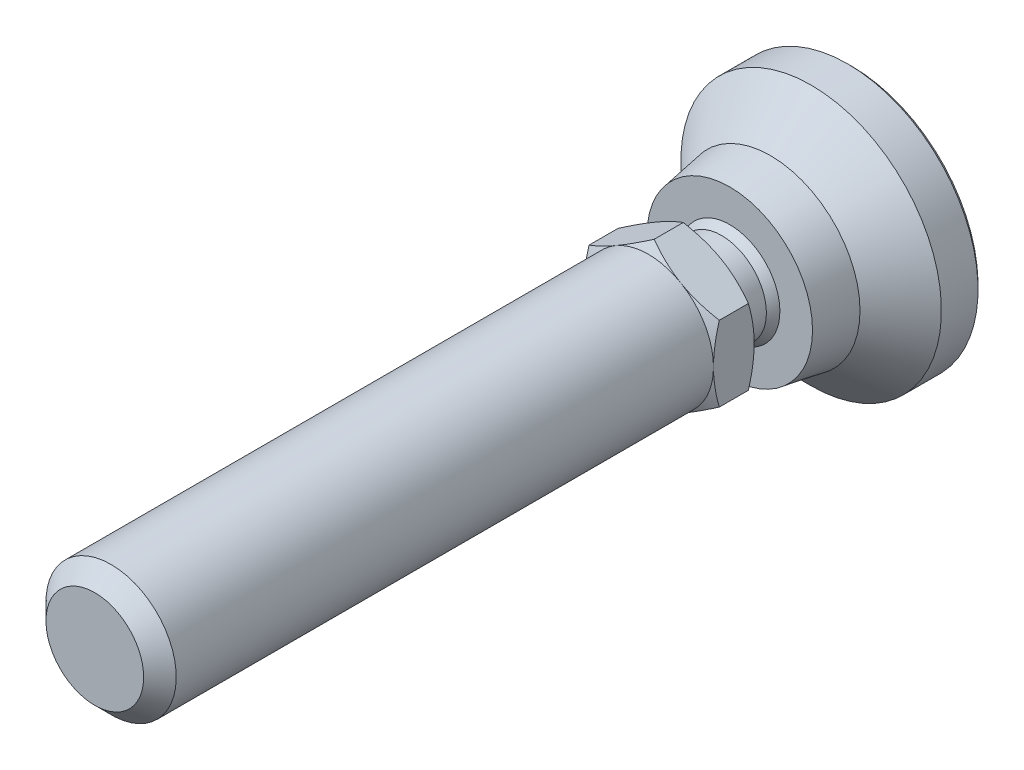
ISO-10303-21;
HEADER;
FILE_DESCRIPTION(('STEP AP214'),'2;1');
FILE_NAME('part.step','',(''),(''),'','','');
FILE_SCHEMA(('AUTOMOTIVE_DESIGN { 1 0 10303 214 1 1 1 1 }'));
ENDSEC;
DATA;
#1=APPLICATION_CONTEXT('core data for automotive mechanical design processes');
#2=APPLICATION_PROTOCOL_DEFINITION('international standard','automotive_design',2000,#1);
#3=PRODUCT_CONTEXT('',#1,'mechanical');
#4=PRODUCT('Part','Part','',(#3));
#5=PRODUCT_RELATED_PRODUCT_CATEGORY('part','',(#4));
#6=PRODUCT_DEFINITION_FORMATION('','',#4);
#7=PRODUCT_DEFINITION_CONTEXT('part definition',#1,'design');
#8=PRODUCT_DEFINITION('design','',#6,#7);
#9=PRODUCT_DEFINITION_SHAPE('','',#8);
#10=(LENGTH_UNIT() NAMED_UNIT(*) SI_UNIT(.MILLI.,.METRE.));
#11=(NAMED_UNIT(*) PLANE_ANGLE_UNIT() SI_UNIT($,.RADIAN.));
#12=(NAMED_UNIT(*) SI_UNIT($,.STERADIAN.) SOLID_ANGLE_UNIT());
#13=UNCERTAINTY_MEASURE_WITH_UNIT(LENGTH_MEASURE(1.E-05),#10,'distance_accuracy_value','');
#14=(GEOMETRIC_REPRESENTATION_CONTEXT(3) GLOBAL_UNCERTAINTY_ASSIGNED_CONTEXT((#13)) GLOBAL_UNIT_ASSIGNED_CONTEXT((#10,
#11,#12)) REPRESENTATION_CONTEXT('',''));
#15=CARTESIAN_POINT('',(0.,0.,0.));
#16=DIRECTION('',(0.,0.,1.));
#17=DIRECTION('',(1.,0.,0.));
#18=AXIS2_PLACEMENT_3D('',#15,#16,#17);
#19=CARTESIAN_POINT('',(-7.7647058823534,0.,20.));
#20=DIRECTION('',(0.,0.,1.));
#21=DIRECTION('',(0.,-1.,0.));
#22=AXIS2_PLACEMENT_3D('',#19,#20,#21);
#23=PLANE('',#22);
#24=CARTESIAN_POINT('',(0.,0.,20.));
#25=DIRECTION('',(0.,0.,-1.));
#26=DIRECTION('',(0.,1.,0.));
#27=AXIS2_PLACEMENT_3D('',#24,#25,#26);
#28=CIRCLE('',#27,5.50000000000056);
#29=CARTESIAN_POINT('',(0.,5.50000000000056,20.));
#30=VERTEX_POINT('',#29);
#31=EDGE_CURVE('E275',#30,#30,#28,.T.);
#32=ORIENTED_EDGE('',*,*,#31,.F.);
#33=EDGE_LOOP('',(#32));
#34=FACE_BOUND('',#33,.T.);
#35=CARTESIAN_POINT('',(0.,0.,20.));
#36=DIRECTION('',(0.,0.,1.));
#37=DIRECTION('',(0.,-1.,0.));
#38=AXIS2_PLACEMENT_3D('',#35,#36,#37);
#39=CIRCLE('',#38,8.);
#40=CARTESIAN_POINT('',(4.,-6.92820323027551,20.));
#41=VERTEX_POINT('',#40);
#42=CARTESIAN_POINT('',(-4.,-6.92820323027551,20.));
#43=VERTEX_POINT('',#42);
#44=EDGE_CURVE('E17',#41,#43,#39,.F.);
#45=ORIENTED_EDGE('',*,*,#44,.T.);
#46=CARTESIAN_POINT('',(-8.,0.,20.));
#47=VERTEX_POINT('',#46);
#48=EDGE_CURVE('E9',#43,#47,#39,.F.);
#49=ORIENTED_EDGE('',*,*,#48,.T.);
#50=CARTESIAN_POINT('',(-4.,6.92820323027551,20.));
#51=VERTEX_POINT('',#50);
#52=EDGE_CURVE('E22',#47,#51,#39,.F.);
#53=ORIENTED_EDGE('',*,*,#52,.T.);
#54=CARTESIAN_POINT('',(4.,6.92820323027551,20.));
#55=VERTEX_POINT('',#54);
#56=EDGE_CURVE('E410',#51,#55,#39,.F.);
#57=ORIENTED_EDGE('',*,*,#56,.T.);
#58=CARTESIAN_POINT('',(8.,0.,20.));
#59=VERTEX_POINT('',#58);
#60=EDGE_CURVE('E120',#55,#59,#39,.F.);
#61=ORIENTED_EDGE('',*,*,#60,.T.);
#62=CARTESIAN_POINT('',(0.,0.,20.));
#63=DIRECTION('',(0.,0.,1.));
#64=DIRECTION('',(0.,-1.,0.));
#65=AXIS2_PLACEMENT_3D('',#62,#63,#64);
#66=CIRCLE('',#65,8.);
#67=EDGE_CURVE('E104',#41,#59,#66,.T.);
#68=ORIENTED_EDGE('',*,*,#67,.F.);
#69=EDGE_LOOP('',(#45,#49,#53,#57,#61,#68));
#70=FACE_BOUND('',#69,.T.);
#71=ADVANCED_FACE('F14',(#34,#70),#23,.F.);
#72=CARTESIAN_POINT('',(0.,0.,0.));
#73=DIRECTION('',(0.,0.,-1.));
#74=DIRECTION('',(0.,1.,0.));
#75=AXIS2_PLACEMENT_3D('',#72,#73,#74);
#76=CYLINDRICAL_SURFACE('',#75,5.50000000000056);
#77=CARTESIAN_POINT('',(0.,0.,15.9999999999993));
#78=DIRECTION('',(0.,0.,-1.));
#79=DIRECTION('',(0.,1.,0.));
#80=AXIS2_PLACEMENT_3D('',#77,#78,#79);
#81=CIRCLE('',#80,5.50000000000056);
#82=CARTESIAN_POINT('',(0.,-5.50000000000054,15.9999999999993));
#83=VERTEX_POINT('',#82);
#84=EDGE_CURVE('E239',#83,#83,#81,.T.);
#85=ORIENTED_EDGE('',*,*,#84,.F.);
#86=EDGE_LOOP('',(#85));
#87=FACE_BOUND('',#86,.T.);
#88=ORIENTED_EDGE('',*,*,#31,.T.);
#89=EDGE_LOOP('',(#88));
#90=FACE_BOUND('',#89,.T.);
#91=ADVANCED_FACE('F342',(#87,#90),#76,.T.);
#92=CARTESIAN_POINT('',(0.,0.,11.6698729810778));
#93=DIRECTION('',(0.,0.,-1.));
#94=DIRECTION('',(0.,-1.,0.));
#95=AXIS2_PLACEMENT_3D('',#92,#93,#94);
#96=SPHERICAL_SURFACE('',#95,7.);
#97=CARTESIAN_POINT('',(0.,0.,15.));
#98=DIRECTION('',(0.,0.,-1.));
#99=DIRECTION('',(0.,1.,0.));
#100=AXIS2_PLACEMENT_3D('',#97,#98,#99);
#101=CIRCLE('',#100,6.15713034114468);
#102=CARTESIAN_POINT('',(0.,-6.15713034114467,15.));
#103=VERTEX_POINT('',#102);
#104=EDGE_CURVE('E243',#103,#103,#101,.T.);
#105=CARTESIAN_POINT('',(0.,-5.50000000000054,15.9999999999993));
#106=CARTESIAN_POINT('',(0.,-5.50771979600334,15.9901945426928));
#107=CARTESIAN_POINT('',(0.,-5.5154133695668,15.9803684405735));
#108=CARTESIAN_POINT('',(0.,-5.5307478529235,15.9606752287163));
#109=CARTESIAN_POINT('',(0.,-5.53838876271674,15.9508081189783));
#110=CARTESIAN_POINT('',(0.,-5.55361769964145,15.9310331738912));
#111=CARTESIAN_POINT('',(0.,-5.56120572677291,15.9211253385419));
#112=CARTESIAN_POINT('',(0.,-5.57632868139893,15.9012692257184));
#113=CARTESIAN_POINT('',(0.,-5.58386360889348,15.8913209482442));
#114=CARTESIAN_POINT('',(0.,-5.59888014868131,15.8713842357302));
#115=CARTESIAN_POINT('',(0.,-5.60636176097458,15.8613958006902));
#116=CARTESIAN_POINT('',(0.,-5.62127145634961,15.8413790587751));
#117=CARTESIAN_POINT('',(0.,-5.62869953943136,15.8313507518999));
#118=CARTESIAN_POINT('',(0.,-5.64350196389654,15.8112545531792));
#119=CARTESIAN_POINT('',(0.,-5.65087630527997,15.8011866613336));
#120=CARTESIAN_POINT('',(0.,-5.66557103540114,15.7810115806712));
#121=CARTESIAN_POINT('',(0.,-5.67289142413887,15.7709043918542));
#122=CARTESIAN_POINT('',(0.,-5.68747803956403,15.7506510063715));
#123=CARTESIAN_POINT('',(0.,-5.69474426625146,15.7405048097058));
#124=CARTESIAN_POINT('',(0.,-5.70922234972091,15.7201736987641));
#125=CARTESIAN_POINT('',(0.,-5.71643420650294,15.7099887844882));
#126=CARTESIAN_POINT('',(0.,-5.73080334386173,15.6895805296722));
#127=CARTESIAN_POINT('',(0.,-5.73796062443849,15.6793571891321));
#128=CARTESIAN_POINT('',(0.,-5.75222040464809,15.6588723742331));
#129=CARTESIAN_POINT('',(0.,-5.75932290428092,15.6486108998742));
#130=CARTESIAN_POINT('',(0.,-5.77347291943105,15.6280501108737));
#131=CARTESIAN_POINT('',(0.,-5.78052043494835,15.6177507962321));
#132=CARTESIAN_POINT('',(0.,-5.79456028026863,15.5971146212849));
#133=CARTESIAN_POINT('',(0.,-5.80155261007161,15.5867777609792));
#134=CARTESIAN_POINT('',(0.,-5.81548188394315,15.5660667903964));
#135=CARTESIAN_POINT('',(0.,-5.82241882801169,15.5556926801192));
#136=CARTESIAN_POINT('',(0.,-5.83623713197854,15.5349075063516));
#137=CARTESIAN_POINT('',(0.,-5.84311849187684,15.5244964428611));
#138=CARTESIAN_POINT('',(0.,-5.85682543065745,15.503637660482));
#139=CARTESIAN_POINT('',(0.,-5.86365100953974,15.4931899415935));
#140=CARTESIAN_POINT('',(0.,-5.8772461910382,15.4722581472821));
#141=CARTESIAN_POINT('',(0.,-5.88401579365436,15.4617740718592));
#142=CARTESIAN_POINT('',(0.,-5.89749882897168,15.440769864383));
#143=CARTESIAN_POINT('',(0.,-5.90421226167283,15.4302497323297));
#144=CARTESIAN_POINT('',(0.,-5.91758276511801,15.4091737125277));
#145=CARTESIAN_POINT('',(0.,-5.92423983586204,15.398617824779));
#146=CARTESIAN_POINT('',(0.,-5.93749742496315,15.3774705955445));
#147=CARTESIAN_POINT('',(0.,-5.94409794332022,15.3668792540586));
#148=CARTESIAN_POINT('',(0.,-5.9572422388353,15.3456614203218));
#149=CARTESIAN_POINT('',(0.,-5.96378601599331,15.3350349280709));
#150=CARTESIAN_POINT('',(0.,-5.97681664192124,15.3137470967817));
#151=CARTESIAN_POINT('',(0.,-5.98330349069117,15.3030857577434));
#152=CARTESIAN_POINT('',(0.,-5.99622007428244,15.2817285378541));
#153=CARTESIAN_POINT('',(0.,-6.00264980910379,15.271032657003));
#154=CARTESIAN_POINT('',(0.,-6.0154519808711,15.2496066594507));
#155=CARTESIAN_POINT('',(0.,-6.02182441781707,15.2388765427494));
#156=CARTESIAN_POINT('',(0.,-6.03451181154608,15.2173823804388));
#157=CARTESIAN_POINT('',(0.,-6.04082676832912,15.2066183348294));
#158=CARTESIAN_POINT('',(0.,-6.05339902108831,15.1850566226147));
#159=CARTESIAN_POINT('',(0.,-6.05965631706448,15.1742589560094));
#160=CARTESIAN_POINT('',(0.,-6.07211306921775,15.1526303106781));
#161=CARTESIAN_POINT('',(0.,-6.07831252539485,15.1417993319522));
#162=CARTESIAN_POINT('',(0.,-6.09065342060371,15.1201043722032));
#163=CARTESIAN_POINT('',(0.,-6.09679485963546,15.1092403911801));
#164=CARTESIAN_POINT('',(0.,-6.10901954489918,15.0874797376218));
#165=CARTESIAN_POINT('',(0.,-6.11510279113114,15.0765830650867));
#166=CARTESIAN_POINT('',(0.,-6.12721091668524,15.0547573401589));
#167=CARTESIAN_POINT('',(0.,-6.13323579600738,15.0438282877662));
#168=CARTESIAN_POINT('',(0.,-6.14522701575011,15.0219381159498));
#169=CARTESIAN_POINT('',(0.,-6.15119335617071,15.010976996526));
#170=CARTESIAN_POINT('',(0.,-6.15713034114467,15.));
#171=B_SPLINE_CURVE_WITH_KNOTS('',3,(#105,#106,#107,#108,#109,#110,#111,#112,#113,#114,#115,
#116,#117,#118,#119,#120,#121,#122,#123,#124,#125,#126,#127,#128,#129,#130,#131,#132,#133,#134,
#135,#136,#137,#138,#139,#140,#141,#142,#143,#144,#145,#146,#147,#148,#149,#150,#151,#152,#153,
#154,#155,#156,#157,#158,#159,#160,#161,#162,#163,#164,#165,#166,#167,#168,#169,#170),
.UNSPECIFIED.,.F.,.F.,(4,2,2,2,2,2,2,2,2,2,2,2,2,2,2,2,2,2,2,2,2,2,2,2,2,2,2,2,2,2,2,2,4),(0.,
0.0374389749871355,0.0748779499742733,0.11231692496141,0.149755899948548,0.187194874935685,
0.224633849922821,0.262072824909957,0.299511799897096,0.336950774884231,0.374389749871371,
0.411828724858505,0.449267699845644,0.486706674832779,0.524145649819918,0.561584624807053,
0.59902359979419,0.636462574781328,0.673901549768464,0.711340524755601,0.748779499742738,
0.786218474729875,0.823657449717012,0.86109642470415,0.898535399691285,0.935974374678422,
0.973413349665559,1.0108523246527,1.04829129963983,1.08573027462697,1.12316924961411,
1.16060822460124,1.19804719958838),.UNSPECIFIED.);
#172=EDGE_CURVE('BSEAM338',#83,#103,#171,.T.);
#173=ORIENTED_EDGE('',*,*,#84,.T.);
#174=ORIENTED_EDGE('',*,*,#104,.F.);
#175=ORIENTED_EDGE('',*,*,#172,.T.);
#176=ORIENTED_EDGE('',*,*,#172,.F.);
#177=EDGE_LOOP('',(#173,#175,#174,#176));
#178=FACE_BOUND('',#177,.T.);
#179=ADVANCED_FACE('F338',(#178),#96,.T.);
#180=CARTESIAN_POINT('',(-15.5,0.,0.));
#181=DIRECTION('',(0.,0.,1.));
#182=DIRECTION('',(0.,-1.,0.));
#183=AXIS2_PLACEMENT_3D('',#180,#181,#182);
#184=PLANE('',#183);
#185=CARTESIAN_POINT('',(0.,0.,0.));
#186=DIRECTION('',(0.,0.,-1.));
#187=DIRECTION('',(0.,1.,0.));
#188=AXIS2_PLACEMENT_3D('',#185,#186,#187);
#189=CIRCLE('',#188,15.5);
#190=CARTESIAN_POINT('',(0.,15.5,0.));
#191=VERTEX_POINT('',#190);
#192=EDGE_CURVE('E264',#191,#191,#189,.T.);
#193=ORIENTED_EDGE('',*,*,#192,.T.);
#194=EDGE_LOOP('',(#193));
#195=FACE_BOUND('',#194,.T.);
#196=ADVANCED_FACE('F341',(#195),#184,.F.);
#197=CARTESIAN_POINT('',(0.,0.,0.500000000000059));
#198=DIRECTION('',(0.,0.,1.));
#199=DIRECTION('',(0.,-1.,0.));
#200=AXIS2_PLACEMENT_3D('',#197,#198,#199);
#201=CONICAL_SURFACE('',#200,16.,0.785398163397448);
#202=ORIENTED_EDGE('',*,*,#192,.F.);
#203=EDGE_LOOP('',(#202));
#204=FACE_BOUND('',#203,.T.);
#205=CARTESIAN_POINT('',(0.,0.,0.500000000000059));
#206=DIRECTION('',(0.,0.,-1.));
#207=DIRECTION('',(0.,1.,0.));
#208=AXIS2_PLACEMENT_3D('',#205,#206,#207);
#209=CIRCLE('',#208,16.);
#210=CARTESIAN_POINT('',(0.,16.,0.500000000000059));
#211=VERTEX_POINT('',#210);
#212=EDGE_CURVE('E267',#211,#211,#209,.T.);
#213=ORIENTED_EDGE('',*,*,#212,.T.);
#214=EDGE_LOOP('',(#213));
#215=FACE_BOUND('',#214,.T.);
#216=ADVANCED_FACE('F378',(#204,#215),#201,.T.);
#217=CARTESIAN_POINT('',(0.,0.,0.));
#218=DIRECTION('',(0.,0.,-1.));
#219=DIRECTION('',(0.,1.,0.));
#220=AXIS2_PLACEMENT_3D('',#217,#218,#219);
#221=CYLINDRICAL_SURFACE('',#220,16.);
#222=ORIENTED_EDGE('',*,*,#212,.F.);
#223=EDGE_LOOP('',(#222));
#224=FACE_BOUND('',#223,.T.);
#225=CARTESIAN_POINT('',(0.,0.,5.));
#226=DIRECTION('',(0.,0.,-1.));
#227=DIRECTION('',(0.,1.,0.));
#228=AXIS2_PLACEMENT_3D('',#225,#226,#227);
#229=CIRCLE('',#228,16.);
#230=CARTESIAN_POINT('',(0.,16.,5.));
#231=VERTEX_POINT('',#230);
#232=EDGE_CURVE('E270',#231,#231,#229,.T.);
#233=ORIENTED_EDGE('',*,*,#232,.T.);
#234=EDGE_LOOP('',(#233));
#235=FACE_BOUND('',#234,.T.);
#236=ADVANCED_FACE('F374',(#224,#235),#221,.T.);
#237=CARTESIAN_POINT('',(0.,0.,10.));
#238=DIRECTION('',(0.,0.,-1.));
#239=DIRECTION('',(0.,1.,0.));
#240=AXIS2_PLACEMENT_3D('',#237,#238,#239);
#241=CONICAL_SURFACE('',#240,11.,0.785398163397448);
#242=ORIENTED_EDGE('',*,*,#232,.F.);
#243=EDGE_LOOP('',(#242));
#244=FACE_BOUND('',#243,.T.);
#245=CARTESIAN_POINT('',(0.,0.,10.));
#246=DIRECTION('',(0.,0.,-1.));
#247=DIRECTION('',(0.,1.,0.));
#248=AXIS2_PLACEMENT_3D('',#245,#246,#247);
#249=CIRCLE('',#248,11.);
#250=CARTESIAN_POINT('',(0.,11.,10.));
#251=VERTEX_POINT('',#250);
#252=EDGE_CURVE('E273',#251,#251,#249,.T.);
#253=ORIENTED_EDGE('',*,*,#252,.T.);
#254=EDGE_LOOP('',(#253));
#255=FACE_BOUND('',#254,.T.);
#256=ADVANCED_FACE('F370',(#244,#255),#241,.T.);
#257=CARTESIAN_POINT('',(0.,0.,16.));
#258=DIRECTION('',(0.,0.,-1.));
#259=DIRECTION('',(0.,1.,0.));
#260=AXIS2_PLACEMENT_3D('',#257,#258,#259);
#261=CONICAL_SURFACE('',#260,10.,0.165148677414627);
#262=CARTESIAN_POINT('',(0.,0.,15.));
#263=DIRECTION('',(0.,0.,1.));
#264=DIRECTION('',(0.,-1.,0.));
#265=AXIS2_PLACEMENT_3D('',#262,#263,#264);
#266=CIRCLE('',#265,10.1666666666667);
#267=CARTESIAN_POINT('',(0.,-10.1666666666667,15.));
#268=VERTEX_POINT('',#267);
#269=EDGE_CURVE('E246',#268,#268,#266,.T.);
#270=ORIENTED_EDGE('',*,*,#269,.F.);
#271=EDGE_LOOP('',(#270));
#272=FACE_BOUND('',#271,.T.);
#273=ORIENTED_EDGE('',*,*,#252,.F.);
#274=EDGE_LOOP('',(#273));
#275=FACE_BOUND('',#274,.T.);
#276=ADVANCED_FACE('F336',(#272,#275),#261,.T.);
#277=CARTESIAN_POINT('',(-6.60079601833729,0.,15.));
#278=DIRECTION('',(0.,0.,-1.));
#279=DIRECTION('',(0.,1.,0.));
#280=AXIS2_PLACEMENT_3D('',#277,#278,#279);
#281=PLANE('',#280);
#282=ORIENTED_EDGE('',*,*,#269,.T.);
#283=EDGE_LOOP('',(#282));
#284=FACE_BOUND('',#283,.T.);
#285=ORIENTED_EDGE('',*,*,#104,.T.);
#286=EDGE_LOOP('',(#285));
#287=FACE_BOUND('',#286,.T.);
#288=ADVANCED_FACE('F332',(#284,#287),#281,.F.);
#289=CARTESIAN_POINT('',(0.,0.,20.));
#290=DIRECTION('',(0.,0.,1.));
#291=DIRECTION('',(0.,-1.,0.));
#292=AXIS2_PLACEMENT_3D('',#289,#290,#291);
#293=CONICAL_SURFACE('',#292,8.,1.0471975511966);
#294=ORIENTED_EDGE('',*,*,#44,.F.);
#295=CARTESIAN_POINT('',(-0.000199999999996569,-9.23771977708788,20.714597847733));
#296=CARTESIAN_POINT('',(0.175648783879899,-9.13619343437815,20.6559907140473));
#297=CARTESIAN_POINT('',(0.352153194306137,-9.03428856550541,20.6000434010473));
#298=CARTESIAN_POINT('',(0.706595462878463,-8.829651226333,20.4942010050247));
#299=CARTESIAN_POINT('',(0.884533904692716,-8.72691841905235,20.4443085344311));
#300=CARTESIAN_POINT('',(1.42119823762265,-8.41707512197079,20.3046927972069));
#301=CARTESIAN_POINT('',(1.78204258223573,-8.20874154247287,20.2252811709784));
#302=CARTESIAN_POINT('',(2.32203917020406,-7.89697436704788,20.1321616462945));
#303=CARTESIAN_POINT('',(2.49957818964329,-7.79447216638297,20.1056345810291));
#304=CARTESIAN_POINT('',(2.85545911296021,-7.5890042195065,20.0611531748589));
#305=CARTESIAN_POINT('',(3.03380094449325,-7.48603851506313,20.0431980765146));
#306=CARTESIAN_POINT('',(3.3907916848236,-7.27992981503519,20.0163156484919));
#307=CARTESIAN_POINT('',(3.56944001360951,-7.17678715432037,20.0073780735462));
#308=CARTESIAN_POINT('',(3.9269017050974,-6.97040655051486,19.9987223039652));
#309=CARTESIAN_POINT('',(4.10571506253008,-6.8671686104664,19.9990038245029));
#310=CARTESIAN_POINT('',(4.44001336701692,-6.67416139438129,20.0081450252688));
#311=CARTESIAN_POINT('',(4.59552190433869,-6.58437849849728,20.0158896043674));
#312=CARTESIAN_POINT('',(4.90617476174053,-6.4050229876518,20.0382011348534));
#313=CARTESIAN_POINT('',(5.06131905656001,-6.31545038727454,20.0527685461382));
#314=CARTESIAN_POINT('',(5.52615131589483,-6.04707935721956,20.1063606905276));
#315=CARTESIAN_POINT('',(5.83501648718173,-5.86875596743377,20.1552686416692));
#316=CARTESIAN_POINT('',(6.45602322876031,-5.5102175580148,20.2775394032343));
#317=CARTESIAN_POINT('',(6.76808554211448,-5.33004829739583,20.351420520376));
#318=CARTESIAN_POINT('',(7.38755648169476,-4.97239658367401,20.519100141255));
#319=CARTESIAN_POINT('',(7.69497304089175,-4.79490955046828,20.6128592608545));
#320=CARTESIAN_POINT('',(8.0002,-4.6186866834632,20.714597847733));
#321=B_SPLINE_CURVE_WITH_KNOTS('',3,(#295,#296,#297,#298,#299,#300,#301,#302,#303,#304,#305,
#306,#307,#308,#309,#310,#311,#312,#313,#314,#315,#316,#317,#318,#319,#320),.UNSPECIFIED.,.F.,
.F.,(4,2,2,2,2,2,2,2,2,2,2,2,4),(0.,0.633973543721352,1.26821965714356,2.53934712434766,
3.1593434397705,3.77928496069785,4.39852133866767,5.01773858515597,5.5568023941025,
6.09590254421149,7.17487077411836,8.27776850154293,9.37850115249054),.UNSPECIFIED.);
#322=CARTESIAN_POINT('',(0.,-9.23760430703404,20.7145311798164));
#323=VERTEX_POINT('',#322);
#324=EDGE_CURVE('E112',#323,#41,#321,.T.);
#325=ORIENTED_EDGE('',*,*,#324,.F.);
#326=CARTESIAN_POINT('',(-8.0002,-4.6186866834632,20.714597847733));
#327=CARTESIAN_POINT('',(-7.82435121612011,-4.72021302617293,20.6559907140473));
#328=CARTESIAN_POINT('',(-7.64784680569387,-4.82211789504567,20.6000434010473));
#329=CARTESIAN_POINT('',(-7.29340453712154,-5.02675523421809,20.4942010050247));
#330=CARTESIAN_POINT('',(-7.11546609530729,-5.12948804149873,20.4443085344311));
#331=CARTESIAN_POINT('',(-6.57880176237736,-5.43933133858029,20.3046927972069));
#332=CARTESIAN_POINT('',(-6.21795741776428,-5.64766491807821,20.2252811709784));
#333=CARTESIAN_POINT('',(-5.67796082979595,-5.9594320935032,20.1321616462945));
#334=CARTESIAN_POINT('',(-5.50042181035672,-6.06193429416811,20.1056345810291));
#335=CARTESIAN_POINT('',(-5.1445408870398,-6.26740224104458,20.0611531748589));
#336=CARTESIAN_POINT('',(-4.96619905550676,-6.37036794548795,20.0431980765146));
#337=CARTESIAN_POINT('',(-4.6092083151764,-6.57647664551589,20.0163156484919));
#338=CARTESIAN_POINT('',(-4.43055998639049,-6.67961930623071,20.0073780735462));
#339=CARTESIAN_POINT('',(-4.07309829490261,-6.88599991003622,19.9987223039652));
#340=CARTESIAN_POINT('',(-3.89428493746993,-6.98923785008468,19.9990038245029));
#341=CARTESIAN_POINT('',(-3.55998663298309,-7.18224506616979,20.0081450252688));
#342=CARTESIAN_POINT('',(-3.40447809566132,-7.2720279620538,20.0158896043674));
#343=CARTESIAN_POINT('',(-3.09382523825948,-7.45138347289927,20.0382011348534));
#344=CARTESIAN_POINT('',(-2.93868094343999,-7.54095607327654,20.0527685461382));
#345=CARTESIAN_POINT('',(-2.47384868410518,-7.80932710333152,20.1063606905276));
#346=CARTESIAN_POINT('',(-2.16498351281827,-7.98765049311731,20.1552686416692));
#347=CARTESIAN_POINT('',(-1.54397677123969,-8.34618890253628,20.2775394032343));
#348=CARTESIAN_POINT('',(-1.23191445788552,-8.52635816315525,20.351420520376));
#349=CARTESIAN_POINT('',(-0.612443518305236,-8.88400987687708,20.519100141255));
#350=CARTESIAN_POINT('',(-0.305026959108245,-9.06149691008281,20.6128592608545));
#351=CARTESIAN_POINT('',(0.000200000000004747,-9.23771977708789,20.714597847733));
#352=B_SPLINE_CURVE_WITH_KNOTS('',3,(#326,#327,#328,#329,#330,#331,#332,#333,#334,#335,#336,
#337,#338,#339,#340,#341,#342,#343,#344,#345,#346,#347,#348,#349,#350,#351),.UNSPECIFIED.,.F.,
.F.,(4,2,2,2,2,2,2,2,2,2,2,2,4),(0.,0.633973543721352,1.26821965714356,2.53934712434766,
3.15934343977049,3.77928496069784,4.39852133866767,5.01773858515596,5.5568023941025,
6.09590254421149,7.17487077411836,8.27776850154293,9.37850115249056),.UNSPECIFIED.);
#353=EDGE_CURVE('E118',#43,#323,#352,.T.);
#354=ORIENTED_EDGE('',*,*,#353,.F.);
#355=EDGE_LOOP('',(#294,#325,#354));
#356=FACE_BOUND('',#355,.T.);
#357=ADVANCED_FACE('F116',(#356),#293,.T.);
#358=ORIENTED_EDGE('',*,*,#67,.T.);
#359=CARTESIAN_POINT('',(8.,12.3223592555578,23.86334650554));
#360=CARTESIAN_POINT('',(8.,11.9736484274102,23.6945312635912));
#361=CARTESIAN_POINT('',(7.99999999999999,11.6241279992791,23.5273592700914));
#362=CARTESIAN_POINT('',(7.99999999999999,10.9230370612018,23.1972277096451));
#363=CARTESIAN_POINT('',(7.99999999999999,10.5714662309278,23.0342688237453));
#364=CARTESIAN_POINT('',(7.99999999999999,9.86399135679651,22.712651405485));
#365=CARTESIAN_POINT('',(7.99999999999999,9.50807408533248,22.5540218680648));
#366=CARTESIAN_POINT('',(7.99999999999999,8.79337910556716,22.2433680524));
#367=CARTESIAN_POINT('',(7.99999999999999,8.43460153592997,22.0913434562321));
#368=CARTESIAN_POINT('',(7.99999999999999,7.70235692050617,21.791028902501));
#369=CARTESIAN_POINT('',(7.99999999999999,7.32878079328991,21.6430034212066));
#370=CARTESIAN_POINT('',(7.99999999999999,6.57722779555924,21.3583611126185));
#371=CARTESIAN_POINT('',(8.,6.19925043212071,21.2217455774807));
#372=CARTESIAN_POINT('',(8.,5.43902425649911,20.9635720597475));
#373=CARTESIAN_POINT('',(7.99999999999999,5.0567861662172,20.8419828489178));
#374=CARTESIAN_POINT('',(8.,4.28684199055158,20.6178173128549));
#375=CARTESIAN_POINT('',(8.,3.89913769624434,20.515234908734));
#376=CARTESIAN_POINT('',(8.,3.12011553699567,20.3346102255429));
#377=CARTESIAN_POINT('',(8.,2.72882868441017,20.256437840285));
#378=CARTESIAN_POINT('',(8.,2.13840363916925,20.1609119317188));
#379=CARTESIAN_POINT('',(8.,1.94099764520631,20.1326907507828));
#380=CARTESIAN_POINT('',(8.,1.54523340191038,20.0840479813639));
#381=CARTESIAN_POINT('',(8.,1.34687524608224,20.0636256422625));
#382=CARTESIAN_POINT('',(8.,0.952026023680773,20.0312391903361));
#383=CARTESIAN_POINT('',(8.,0.755543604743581,20.0191700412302));
#384=CARTESIAN_POINT('',(8.,0.362244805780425,20.0033453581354));
#385=CARTESIAN_POINT('',(8.,0.165428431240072,19.9995896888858));
#386=CARTESIAN_POINT('',(8.,-0.22818735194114,20.0004813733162));
#387=CARTESIAN_POINT('',(8.,-0.424986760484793,20.0051287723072));
#388=CARTESIAN_POINT('',(8.,-0.818217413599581,20.022714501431));
#389=CARTESIAN_POINT('',(8.,-1.01464863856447,20.0356532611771));
#390=CARTESIAN_POINT('',(8.,-1.48933000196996,20.0766676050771));
#391=CARTESIAN_POINT('',(8.,-1.76723494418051,20.108821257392));
#392=CARTESIAN_POINT('',(8.,-2.32091320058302,20.1879500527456));
#393=CARTESIAN_POINT('',(8.,-2.59668620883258,20.2349272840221));
#394=CARTESIAN_POINT('',(8.,-3.42053162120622,20.395597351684));
#395=CARTESIAN_POINT('',(8.,-3.9648077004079,20.5289970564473));
#396=CARTESIAN_POINT('',(8.,-4.7785145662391,20.7594466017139));
#397=CARTESIAN_POINT('',(8.,-5.05218812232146,20.8423696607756));
#398=CARTESIAN_POINT('',(8.,-5.5968758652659,21.0166105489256));
#399=CARTESIAN_POINT('',(8.,-5.86789003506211,21.1079284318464));
#400=CARTESIAN_POINT('',(8.,-6.40734830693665,21.2975120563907));
#401=CARTESIAN_POINT('',(8.,-6.6757932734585,21.3957753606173));
#402=CARTESIAN_POINT('',(8.,-7.21047408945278,21.5981154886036));
#403=CARTESIAN_POINT('',(8.,-7.47670996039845,21.7021922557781));
#404=CARTESIAN_POINT('',(8.,-8.08614880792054,21.9468803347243));
#405=CARTESIAN_POINT('',(8.,-8.42868499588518,22.0891489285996));
#406=CARTESIAN_POINT('',(8.,-9.11099348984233,22.3801832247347));
#407=CARTESIAN_POINT('',(8.,-9.45076565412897,22.5289492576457));
#408=CARTESIAN_POINT('',(8.,-10.1280366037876,22.8317282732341));
#409=CARTESIAN_POINT('',(8.,-10.4655349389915,22.9857422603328));
#410=CARTESIAN_POINT('',(8.,-11.1385569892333,23.2980020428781));
#411=CARTESIAN_POINT('',(8.,-11.4740807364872,23.4562477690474));
#412=CARTESIAN_POINT('',(8.,-12.143772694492,23.7763533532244));
#413=CARTESIAN_POINT('',(8.,-12.4779393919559,23.9382163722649));
#414=CARTESIAN_POINT('',(8.,-13.144863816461,24.2648219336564));
#415=CARTESIAN_POINT('',(8.,-13.4776215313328,24.4295645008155));
#416=CARTESIAN_POINT('',(8.,-14.4741205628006,24.9273790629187));
#417=CARTESIAN_POINT('',(8.,-15.136074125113,25.2640313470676));
#418=CARTESIAN_POINT('',(8.,-16.100202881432,25.7606318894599));
#419=CARTESIAN_POINT('',(8.00000000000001,-16.4037658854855,25.9179025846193));
#420=CARTESIAN_POINT('',(8.00000000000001,-17.0102295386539,26.2337044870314));
#421=CARTESIAN_POINT('',(8.00000000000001,-17.3131301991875,26.3922356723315));
#422=CARTESIAN_POINT('',(8.00000000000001,-18.2209930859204,26.869479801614));
#423=CARTESIAN_POINT('',(8.00000000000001,-18.8250936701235,27.1898316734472));
#424=CARTESIAN_POINT('',(8.00000000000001,-20.0301331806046,27.833153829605));
#425=CARTESIAN_POINT('',(8.00000000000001,-20.6310761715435,28.1561165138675));
#426=CARTESIAN_POINT('',(8.00000000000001,-21.8314940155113,28.804687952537));
#427=CARTESIAN_POINT('',(8.00000000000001,-22.4309689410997,29.1302965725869));
#428=CARTESIAN_POINT('',(8.,-23.0298977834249,29.4569002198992));
#429=B_SPLINE_CURVE_WITH_KNOTS('',3,(#359,#360,#361,#362,#363,#364,#365,#366,#367,#368,#369,
#370,#371,#372,#373,#374,#375,#376,#377,#378,#379,#380,#381,#382,#383,#384,#385,#386,#387,#388,
#389,#390,#391,#392,#393,#394,#395,#396,#397,#398,#399,#400,#401,#402,#403,#404,#405,#406,#407,
#408,#409,#410,#411,#412,#413,#414,#415,#416,#417,#418,#419,#420,#421,#422,#423,#424,#425,#426,
#427,#428),.UNSPECIFIED.,.F.,.F.,(4,2,2,2,2,2,2,2,2,2,2,2,2,2,2,2,2,2,2,2,2,2,2,2,2,2,2,2,2,2,2,
2,2,2,4),(0.,1.16228843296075,2.32476358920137,3.4937111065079,4.66260229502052,
5.86796012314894,7.07345427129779,8.2763994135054,9.47895915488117,10.6749952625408,
11.2731045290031,11.8711562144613,12.461544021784,13.0519222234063,13.6423036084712,
14.232715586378,15.0715163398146,15.9104353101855,17.5892416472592,18.447054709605,
19.3048732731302,20.1623922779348,21.0199029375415,22.1325331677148,23.2452200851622,
24.3581211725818,25.4710040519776,26.5849007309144,27.6988070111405,29.92666499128,
30.9523155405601,31.9779482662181,34.0292898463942,36.0759720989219,38.1225510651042),.UNSPECIFIED.);
#430=CARTESIAN_POINT('',(8.,-4.61880215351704,20.7145311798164));
#431=VERTEX_POINT('',#430);
#432=EDGE_CURVE('E107',#431,#59,#429,.F.);
#433=ORIENTED_EDGE('',*,*,#432,.F.);
#434=EDGE_CURVE('E100',#41,#431,#321,.T.);
#435=ORIENTED_EDGE('',*,*,#434,.F.);
#436=EDGE_LOOP('',(#358,#433,#435));
#437=FACE_BOUND('',#436,.T.);
#438=ADVANCED_FACE('F102',(#437),#293,.T.);
#439=ORIENTED_EDGE('',*,*,#60,.F.);
#440=CARTESIAN_POINT('',(8.0002,4.61868668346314,20.7145978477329));
#441=CARTESIAN_POINT('',(7.8243512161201,4.72021302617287,20.6559907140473));
#442=CARTESIAN_POINT('',(7.64784680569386,4.82211789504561,20.6000434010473));
#443=CARTESIAN_POINT('',(7.29340453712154,5.02675523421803,20.4942010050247));
#444=CARTESIAN_POINT('',(7.11546609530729,5.12948804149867,20.4443085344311));
#445=CARTESIAN_POINT('',(6.57880176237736,5.43933133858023,20.3046927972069));
#446=CARTESIAN_POINT('',(6.21795741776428,5.64766491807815,20.2252811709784));
#447=CARTESIAN_POINT('',(5.67796082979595,5.95943209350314,20.1321616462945));
#448=CARTESIAN_POINT('',(5.50042181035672,6.06193429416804,20.1056345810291));
#449=CARTESIAN_POINT('',(5.14454088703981,6.26740224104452,20.0611531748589));
#450=CARTESIAN_POINT('',(4.96619905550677,6.37036794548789,20.0431980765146));
#451=CARTESIAN_POINT('',(4.60920831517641,6.57647664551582,20.0163156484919));
#452=CARTESIAN_POINT('',(4.43055998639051,6.67961930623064,20.0073780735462));
#453=CARTESIAN_POINT('',(4.07309829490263,6.88599991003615,19.9987223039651));
#454=CARTESIAN_POINT('',(3.89428493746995,6.98923785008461,19.9990038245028));
#455=CARTESIAN_POINT('',(3.55998663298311,7.18224506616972,20.0081450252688));
#456=CARTESIAN_POINT('',(3.40447809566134,7.27202796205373,20.0158896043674));
#457=CARTESIAN_POINT('',(3.0938252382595,7.45138347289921,20.0382011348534));
#458=CARTESIAN_POINT('',(2.93868094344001,7.54095607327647,20.0527685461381));
#459=CARTESIAN_POINT('',(2.47384868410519,7.80932710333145,20.1063606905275));
#460=CARTESIAN_POINT('',(2.16498351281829,7.98765049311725,20.1552686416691));
#461=CARTESIAN_POINT('',(1.54397677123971,8.34618890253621,20.2775394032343));
#462=CARTESIAN_POINT('',(1.23191445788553,8.52635816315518,20.351420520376));
#463=CARTESIAN_POINT('',(0.612443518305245,8.88400987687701,20.519100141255));
#464=CARTESIAN_POINT('',(0.305026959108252,9.06149691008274,20.6128592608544));
#465=CARTESIAN_POINT('',(-0.000200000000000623,9.23771977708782,20.7145978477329));
#466=B_SPLINE_CURVE_WITH_KNOTS('',3,(#440,#441,#442,#443,#444,#445,#446,#447,#448,#449,#450,
#451,#452,#453,#454,#455,#456,#457,#458,#459,#460,#461,#462,#463,#464,#465),.UNSPECIFIED.,.F.,
.F.,(4,2,2,2,2,2,2,2,2,2,2,2,4),(0.,0.633973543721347,1.26821965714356,2.53934712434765,
3.15934343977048,3.77928496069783,4.39852133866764,5.01773858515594,5.55680239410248,
6.09590254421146,7.17487077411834,8.27776850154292,9.37850115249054),.UNSPECIFIED.);
#467=CARTESIAN_POINT('',(8.,4.61880215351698,20.7145311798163));
#468=VERTEX_POINT('',#467);
#469=EDGE_CURVE('E187',#468,#55,#466,.T.);
#470=ORIENTED_EDGE('',*,*,#469,.F.);
#471=EDGE_CURVE('E139',#59,#468,#429,.F.);
#472=ORIENTED_EDGE('',*,*,#471,.F.);
#473=EDGE_LOOP('',(#439,#470,#472));
#474=FACE_BOUND('',#473,.T.);
#475=ADVANCED_FACE('F409',(#474),#293,.T.);
#476=ORIENTED_EDGE('',*,*,#56,.F.);
#477=CARTESIAN_POINT('',(0.000199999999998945,9.23771977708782,20.7145978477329));
#478=CARTESIAN_POINT('',(-0.175648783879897,9.13619343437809,20.6559907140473));
#479=CARTESIAN_POINT('',(-0.352153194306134,9.03428856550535,20.6000434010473));
#480=CARTESIAN_POINT('',(-0.706595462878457,8.82965122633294,20.4942010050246));
#481=CARTESIAN_POINT('',(-0.884533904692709,8.72691841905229,20.4443085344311));
#482=CARTESIAN_POINT('',(-1.42119823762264,8.41707512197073,20.3046927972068));
#483=CARTESIAN_POINT('',(-1.78204258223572,8.20874154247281,20.2252811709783));
#484=CARTESIAN_POINT('',(-2.32203917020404,7.89697436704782,20.1321616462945));
#485=CARTESIAN_POINT('',(-2.49957818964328,7.79447216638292,20.1056345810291));
#486=CARTESIAN_POINT('',(-2.85545911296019,7.58900421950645,20.0611531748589));
#487=CARTESIAN_POINT('',(-3.03380094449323,7.48603851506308,20.0431980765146));
#488=CARTESIAN_POINT('',(-3.39079168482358,7.27992981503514,20.0163156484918));
#489=CARTESIAN_POINT('',(-3.56944001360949,7.17678715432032,20.0073780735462));
#490=CARTESIAN_POINT('',(-3.92690170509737,6.97040655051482,19.9987223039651));
#491=CARTESIAN_POINT('',(-4.10571506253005,6.86716861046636,19.9990038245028));
#492=CARTESIAN_POINT('',(-4.44001336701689,6.67416139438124,20.0081450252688));
#493=CARTESIAN_POINT('',(-4.59552190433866,6.58437849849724,20.0158896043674));
#494=CARTESIAN_POINT('',(-4.9061747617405,6.40502298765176,20.0382011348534));
#495=CARTESIAN_POINT('',(-5.06131905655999,6.31545038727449,20.0527685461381));
#496=CARTESIAN_POINT('',(-5.52615131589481,6.04707935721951,20.1063606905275));
#497=CARTESIAN_POINT('',(-5.83501648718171,5.86875596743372,20.1552686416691));
#498=CARTESIAN_POINT('',(-6.45602322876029,5.51021755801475,20.2775394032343));
#499=CARTESIAN_POINT('',(-6.76808554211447,5.33004829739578,20.351420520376));
#500=CARTESIAN_POINT('',(-7.38755648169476,4.97239658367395,20.519100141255));
#501=CARTESIAN_POINT('',(-7.69497304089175,4.79490955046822,20.6128592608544));
#502=CARTESIAN_POINT('',(-8.0002,4.61868668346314,20.7145978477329));
#503=B_SPLINE_CURVE_WITH_KNOTS('',3,(#477,#478,#479,#480,#481,#482,#483,#484,#485,#486,#487,
#488,#489,#490,#491,#492,#493,#494,#495,#496,#497,#498,#499,#500,#501,#502),.UNSPECIFIED.,.F.,
.F.,(4,2,2,2,2,2,2,2,2,2,2,2,4),(0.,0.633973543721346,1.26821965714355,2.53934712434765,
3.15934343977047,3.77928496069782,4.39852133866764,5.01773858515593,5.55680239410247,
6.09590254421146,7.17487077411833,8.27776850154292,9.37850115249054),.UNSPECIFIED.);
#504=CARTESIAN_POINT('',(0.,9.23760430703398,20.7145311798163));
#505=VERTEX_POINT('',#504);
#506=EDGE_CURVE('E188',#505,#51,#503,.T.);
#507=ORIENTED_EDGE('',*,*,#506,.F.);
#508=EDGE_CURVE('E180',#55,#505,#466,.T.);
#509=ORIENTED_EDGE('',*,*,#508,.F.);
#510=EDGE_LOOP('',(#476,#507,#509));
#511=FACE_BOUND('',#510,.T.);
#512=ADVANCED_FACE('F416',(#511),#293,.T.);
#513=ORIENTED_EDGE('',*,*,#52,.F.);
#514=CARTESIAN_POINT('',(-8.,12.3223592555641,23.863346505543));
#515=CARTESIAN_POINT('',(-8.,11.9736484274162,23.6945312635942));
#516=CARTESIAN_POINT('',(-8.,11.624127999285,23.5273592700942));
#517=CARTESIAN_POINT('',(-8.,10.9230370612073,23.1972277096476));
#518=CARTESIAN_POINT('',(-8.,10.571466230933,23.0342688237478));
#519=CARTESIAN_POINT('',(-8.,9.86399135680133,22.7126514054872));
#520=CARTESIAN_POINT('',(-8.,9.50807408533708,22.5540218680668));
#521=CARTESIAN_POINT('',(-8.,8.79337910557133,22.2433680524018));
#522=CARTESIAN_POINT('',(-8.,8.43460153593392,22.0913434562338));
#523=CARTESIAN_POINT('',(-8.,7.70235692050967,21.7910289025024));
#524=CARTESIAN_POINT('',(-8.,7.32878079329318,21.6430034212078));
#525=CARTESIAN_POINT('',(-8.,6.57722779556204,21.3583611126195));
#526=CARTESIAN_POINT('',(-8.,6.19925043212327,21.2217455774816));
#527=CARTESIAN_POINT('',(-8.,5.43902425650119,20.9635720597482));
#528=CARTESIAN_POINT('',(-8.,5.05678616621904,20.8419828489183));
#529=CARTESIAN_POINT('',(-8.,4.28684199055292,20.6178173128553));
#530=CARTESIAN_POINT('',(-8.,3.89913769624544,20.5152349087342));
#531=CARTESIAN_POINT('',(-8.,3.12011553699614,20.334610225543));
#532=CARTESIAN_POINT('',(-8.,2.72882868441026,20.256437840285));
#533=CARTESIAN_POINT('',(-8.,2.13840363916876,20.1609119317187));
#534=CARTESIAN_POINT('',(-8.,1.94099764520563,20.1326907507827));
#535=CARTESIAN_POINT('',(-8.,1.5452334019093,20.0840479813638));
#536=CARTESIAN_POINT('',(-8.,1.34687524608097,20.0636256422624));
#537=CARTESIAN_POINT('',(-8.,0.952026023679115,20.031239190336));
#538=CARTESIAN_POINT('',(-8.,0.755543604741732,20.0191700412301));
#539=CARTESIAN_POINT('',(-8.,0.362244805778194,20.0033453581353));
#540=CARTESIAN_POINT('',(-8.,0.16542843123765,19.9995896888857));
#541=CARTESIAN_POINT('',(-8.,-0.228187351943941,20.0004813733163));
#542=CARTESIAN_POINT('',(-8.,-0.424986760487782,20.0051287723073));
#543=CARTESIAN_POINT('',(-8.,-0.818217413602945,20.0227145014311));
#544=CARTESIAN_POINT('',(-8.,-1.01464863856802,20.0356532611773));
#545=CARTESIAN_POINT('',(-8.,-1.4893300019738,20.0766676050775));
#546=CARTESIAN_POINT('',(-8.,-1.76723494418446,20.1088212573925));
#547=CARTESIAN_POINT('',(-8.,-2.32091320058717,20.1879500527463));
#548=CARTESIAN_POINT('',(-8.,-2.59668620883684,20.2349272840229));
#549=CARTESIAN_POINT('',(-8.,-3.42053162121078,20.3955973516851));
#550=CARTESIAN_POINT('',(-8.,-3.96480770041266,20.5289970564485));
#551=CARTESIAN_POINT('',(-8.,-4.77851456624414,20.7594466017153));
#552=CARTESIAN_POINT('',(-8.,-5.0521881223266,20.8423696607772));
#553=CARTESIAN_POINT('',(-8.,-5.59687586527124,21.0166105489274));
#554=CARTESIAN_POINT('',(-8.,-5.86789003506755,21.1079284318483));
#555=CARTESIAN_POINT('',(-8.,-6.40734830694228,21.2975120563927));
#556=CARTESIAN_POINT('',(-8.,-6.67579327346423,21.3957753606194));
#557=CARTESIAN_POINT('',(-8.,-7.21047408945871,21.5981154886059));
#558=CARTESIAN_POINT('',(-8.,-7.47670996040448,21.7021922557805));
#559=CARTESIAN_POINT('',(-8.,-8.08614880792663,21.9468803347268));
#560=CARTESIAN_POINT('',(-8.,-8.42868499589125,22.0891489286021));
#561=CARTESIAN_POINT('',(-8.,-9.11099348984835,22.3801832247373));
#562=CARTESIAN_POINT('',(-8.,-9.45076565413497,22.5289492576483));
#563=CARTESIAN_POINT('',(-8.,-10.1280366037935,22.8317282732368));
#564=CARTESIAN_POINT('',(-8.,-10.4655349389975,22.9857422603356));
#565=CARTESIAN_POINT('',(-8.,-11.1385569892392,23.2980020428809));
#566=CARTESIAN_POINT('',(-8.,-11.4740807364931,23.4562477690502));
#567=CARTESIAN_POINT('',(-8.,-12.1437726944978,23.7763533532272));
#568=CARTESIAN_POINT('',(-8.,-12.4779393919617,23.9382163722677));
#569=CARTESIAN_POINT('',(-8.,-13.1448638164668,24.2648219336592));
#570=CARTESIAN_POINT('',(-8.,-13.4776215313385,24.4295645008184));
#571=CARTESIAN_POINT('',(-8.,-14.4741205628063,24.9273790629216));
#572=CARTESIAN_POINT('',(-8.,-15.1360741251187,25.2640313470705));
#573=CARTESIAN_POINT('',(-8.,-16.1002028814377,25.7606318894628));
#574=CARTESIAN_POINT('',(-8.,-16.4037658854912,25.9179025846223));
#575=CARTESIAN_POINT('',(-8.,-17.0102295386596,26.2337044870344));
#576=CARTESIAN_POINT('',(-8.,-17.3131301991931,26.3922356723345));
#577=CARTESIAN_POINT('',(-8.,-18.2209930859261,26.869479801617));
#578=CARTESIAN_POINT('',(-7.99999999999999,-18.8250936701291,27.1898316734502));
#579=CARTESIAN_POINT('',(-7.99999999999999,-20.0301331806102,27.833153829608));
#580=CARTESIAN_POINT('',(-7.99999999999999,-20.6310761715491,28.1561165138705));
#581=CARTESIAN_POINT('',(-7.99999999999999,-21.8314940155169,28.80468795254));
#582=CARTESIAN_POINT('',(-8.,-22.4309689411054,29.1302965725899));
#583=CARTESIAN_POINT('',(-8.,-23.0298977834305,29.4569002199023));
#584=B_SPLINE_CURVE_WITH_KNOTS('',3,(#514,#515,#516,#517,#518,#519,#520,#521,#522,#523,#524,
#525,#526,#527,#528,#529,#530,#531,#532,#533,#534,#535,#536,#537,#538,#539,#540,#541,#542,#543,
#544,#545,#546,#547,#548,#549,#550,#551,#552,#553,#554,#555,#556,#557,#558,#559,#560,#561,#562,
#563,#564,#565,#566,#567,#568,#569,#570,#571,#572,#573,#574,#575,#576,#577,#578,#579,#580,#581,
#582,#583),.UNSPECIFIED.,.F.,.F.,(4,2,2,2,2,2,2,2,2,2,2,2,2,2,2,2,2,2,2,2,2,2,2,2,2,2,2,2,2,2,2,
2,2,2,4),(0.,1.16228843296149,2.32476358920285,3.49371110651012,4.66260229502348,
5.8679601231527,7.07345427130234,8.27639941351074,9.4789591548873,10.6749952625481,
11.273104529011,11.8711562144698,12.461544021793,13.0519222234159,13.6423036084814,
14.2327155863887,15.0715163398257,15.9104353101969,17.5892416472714,18.4470547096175,
19.3048732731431,20.162392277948,21.0199029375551,22.1325331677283,23.2452200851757,
24.3581211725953,25.4710040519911,26.5849007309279,27.6988070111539,29.9266649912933,
30.9523155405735,31.9779482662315,34.0292898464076,36.0759720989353,38.1225510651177),.UNSPECIFIED.);
#585=CARTESIAN_POINT('',(-8.,4.61880215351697,20.7145311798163));
#586=VERTEX_POINT('',#585);
#587=EDGE_CURVE('E418',#586,#47,#584,.T.);
#588=ORIENTED_EDGE('',*,*,#587,.F.);
#589=EDGE_CURVE('E173',#51,#586,#503,.T.);
#590=ORIENTED_EDGE('',*,*,#589,.F.);
#591=EDGE_LOOP('',(#513,#588,#590));
#592=FACE_BOUND('',#591,.T.);
#593=ADVANCED_FACE('F158',(#592),#293,.T.);
#594=CARTESIAN_POINT('',(-8.,-4.61880215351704,20.7145311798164));
#595=VERTEX_POINT('',#594);
#596=EDGE_CURVE('E124',#47,#595,#584,.T.);
#597=ORIENTED_EDGE('',*,*,#596,.F.);
#598=ORIENTED_EDGE('',*,*,#48,.F.);
#599=EDGE_CURVE('E31',#595,#43,#352,.T.);
#600=ORIENTED_EDGE('',*,*,#599,.F.);
#601=EDGE_LOOP('',(#597,#598,#600));
#602=FACE_BOUND('',#601,.T.);
#603=ADVANCED_FACE('F153',(#602),#293,.T.);
#604=CARTESIAN_POINT('',(0.,0.,93.));
#605=DIRECTION('',(0.,0.,-1.));
#606=DIRECTION('',(0.,1.,0.));
#607=AXIS2_PLACEMENT_3D('',#604,#605,#606);
#608=PLANE('',#607);
#609=CARTESIAN_POINT('',(0.,0.,93.));
#610=DIRECTION('',(0.,0.,-1.));
#611=DIRECTION('',(0.,1.,0.));
#612=AXIS2_PLACEMENT_3D('',#609,#610,#611);
#613=CIRCLE('',#612,6.);
#614=CARTESIAN_POINT('',(0.,6.,93.));
#615=VERTEX_POINT('',#614);
#616=EDGE_CURVE('E230',#615,#615,#613,.T.);
#617=ORIENTED_EDGE('',*,*,#616,.F.);
#618=EDGE_LOOP('',(#617));
#619=FACE_BOUND('',#618,.T.);
#620=ADVANCED_FACE('F157',(#619),#608,.F.);
#621=CARTESIAN_POINT('',(0.,0.,93.));
#622=DIRECTION('',(0.,0.,-1.));
#623=DIRECTION('',(0.,1.,0.));
#624=AXIS2_PLACEMENT_3D('',#621,#622,#623);
#625=CONICAL_SURFACE('',#624,6.,0.785398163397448);
#626=CARTESIAN_POINT('',(0.,0.,91.));
#627=DIRECTION('',(0.,0.,-1.));
#628=DIRECTION('',(0.,1.,0.));
#629=AXIS2_PLACEMENT_3D('',#626,#627,#628);
#630=CIRCLE('',#629,8.);
#631=CARTESIAN_POINT('',(0.,8.,91.));
#632=VERTEX_POINT('',#631);
#633=EDGE_CURVE('E233',#632,#632,#630,.T.);
#634=ORIENTED_EDGE('',*,*,#633,.F.);
#635=EDGE_LOOP('',(#634));
#636=FACE_BOUND('',#635,.T.);
#637=ORIENTED_EDGE('',*,*,#616,.T.);
#638=EDGE_LOOP('',(#637));
#639=FACE_BOUND('',#638,.T.);
#640=ADVANCED_FACE('F346',(#636,#639),#625,.T.);
#641=CARTESIAN_POINT('',(0.,0.,-2.68477183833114));
#642=DIRECTION('',(0.,0.,-1.));
#643=DIRECTION('',(0.,1.,0.));
#644=AXIS2_PLACEMENT_3D('',#641,#642,#643);
#645=CYLINDRICAL_SURFACE('',#644,8.);
#646=CARTESIAN_POINT('',(0.,0.,25.));
#647=DIRECTION('',(0.,0.,-1.));
#648=DIRECTION('',(0.,1.,0.));
#649=AXIS2_PLACEMENT_3D('',#646,#647,#648);
#650=CIRCLE('',#649,8.);
#651=CARTESIAN_POINT('',(4.,6.92820323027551,25.));
#652=VERTEX_POINT('',#651);
#653=CARTESIAN_POINT('',(8.,0.,25.));
#654=VERTEX_POINT('',#653);
#655=EDGE_CURVE('E236',#652,#654,#650,.T.);
#656=ORIENTED_EDGE('',*,*,#655,.F.);
#657=CARTESIAN_POINT('',(-4.,6.92820323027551,25.));
#658=VERTEX_POINT('',#657);
#659=EDGE_CURVE('E240',#658,#652,#650,.T.);
#660=ORIENTED_EDGE('',*,*,#659,.F.);
#661=CARTESIAN_POINT('',(-8.,0.,25.));
#662=VERTEX_POINT('',#661);
#663=EDGE_CURVE('E280',#662,#658,#650,.T.);
#664=ORIENTED_EDGE('',*,*,#663,.F.);
#665=CARTESIAN_POINT('',(-4.,-6.92820323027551,25.));
#666=VERTEX_POINT('',#665);
#667=EDGE_CURVE('E285',#666,#662,#650,.T.);
#668=ORIENTED_EDGE('',*,*,#667,.F.);
#669=CARTESIAN_POINT('',(4.,-6.92820323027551,25.));
#670=VERTEX_POINT('',#669);
#671=EDGE_CURVE('E121',#670,#666,#650,.T.);
#672=ORIENTED_EDGE('',*,*,#671,.F.);
#673=CARTESIAN_POINT('',(0.,0.,25.));
#674=DIRECTION('',(0.,0.,1.));
#675=DIRECTION('',(0.,-1.,0.));
#676=AXIS2_PLACEMENT_3D('',#673,#674,#675);
#677=CIRCLE('',#676,8.);
#678=EDGE_CURVE('E325',#670,#654,#677,.T.);
#679=ORIENTED_EDGE('',*,*,#678,.T.);
#680=EDGE_LOOP('',(#656,#660,#664,#668,#672,#679));
#681=FACE_BOUND('',#680,.T.);
#682=ORIENTED_EDGE('',*,*,#633,.T.);
#683=EDGE_LOOP('',(#682));
#684=FACE_BOUND('',#683,.T.);
#685=ADVANCED_FACE('F301',(#681,#684),#645,.T.);
#686=CARTESIAN_POINT('',(0.,0.,23.7630055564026));
#687=DIRECTION('',(0.,0.,-1.));
#688=DIRECTION('',(0.,1.,0.));
#689=AXIS2_PLACEMENT_3D('',#686,#687,#688);
#690=CONICAL_SURFACE('',#689,10.1425372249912,1.0471975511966);
#691=ORIENTED_EDGE('',*,*,#671,.T.);
#692=CARTESIAN_POINT('',(0.000200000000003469,-9.23771977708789,24.285402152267));
#693=CARTESIAN_POINT('',(-0.175648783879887,-9.13619343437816,24.3440092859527));
#694=CARTESIAN_POINT('',(-0.352153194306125,-9.03428856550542,24.3999565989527));
#695=CARTESIAN_POINT('',(-0.70659546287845,-8.829651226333,24.5057989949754));
#696=CARTESIAN_POINT('',(-0.884533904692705,-8.72691841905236,24.5556914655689));
#697=CARTESIAN_POINT('',(-1.42119823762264,-8.41707512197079,24.6953072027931));
#698=CARTESIAN_POINT('',(-1.78204258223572,-8.20874154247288,24.7747188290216));
#699=CARTESIAN_POINT('',(-2.32203917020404,-7.89697436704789,24.8678383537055));
#700=CARTESIAN_POINT('',(-2.49957818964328,-7.79447216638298,24.8943654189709));
#701=CARTESIAN_POINT('',(-2.85545911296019,-7.58900421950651,24.9388468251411));
#702=CARTESIAN_POINT('',(-3.03380094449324,-7.48603851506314,24.9568019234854));
#703=CARTESIAN_POINT('',(-3.39079168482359,-7.2799298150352,24.9836843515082));
#704=CARTESIAN_POINT('',(-3.5694400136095,-7.17678715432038,24.9926219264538));
#705=CARTESIAN_POINT('',(-3.92690170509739,-6.97040655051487,25.0012776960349));
#706=CARTESIAN_POINT('',(-4.10571506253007,-6.86716861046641,25.0009961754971));
#707=CARTESIAN_POINT('',(-4.44001336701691,-6.6741613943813,24.9918549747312));
#708=CARTESIAN_POINT('',(-4.59552190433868,-6.58437849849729,24.9841103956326));
#709=CARTESIAN_POINT('',(-4.90617476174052,-6.40502298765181,24.9617988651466));
#710=CARTESIAN_POINT('',(-5.06131905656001,-6.31545038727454,24.9472314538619));
#711=CARTESIAN_POINT('',(-5.52615131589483,-6.04707935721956,24.8936393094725));
#712=CARTESIAN_POINT('',(-5.83501648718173,-5.86875596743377,24.8447313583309));
#713=CARTESIAN_POINT('',(-6.4560232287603,-5.51021755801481,24.7224605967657));
#714=CARTESIAN_POINT('',(-6.76808554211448,-5.33004829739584,24.648579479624));
#715=CARTESIAN_POINT('',(-7.38755648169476,-4.97239658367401,24.4808998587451));
#716=CARTESIAN_POINT('',(-7.69497304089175,-4.79490955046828,24.3871407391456));
#717=CARTESIAN_POINT('',(-8.0002,-4.6186866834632,24.285402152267));
#718=B_SPLINE_CURVE_WITH_KNOTS('',3,(#692,#693,#694,#695,#696,#697,#698,#699,#700,#701,#702,
#703,#704,#705,#706,#707,#708,#709,#710,#711,#712,#713,#714,#715,#716,#717),.UNSPECIFIED.,.F.,
.F.,(4,2,2,2,2,2,2,2,2,2,2,2,4),(0.,0.633973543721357,1.26821965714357,2.53934712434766,
3.1593434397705,3.77928496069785,4.39852133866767,5.01773858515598,5.55680239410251,
6.0959025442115,7.17487077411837,8.27776850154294,9.37850115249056),.UNSPECIFIED.);
#719=CARTESIAN_POINT('',(0.,-9.23760430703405,24.2854688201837));
#720=VERTEX_POINT('',#719);
#721=EDGE_CURVE('E297',#720,#666,#718,.T.);
#722=ORIENTED_EDGE('',*,*,#721,.F.);
#723=CARTESIAN_POINT('',(8.0002,-4.6186866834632,24.285402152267));
#724=CARTESIAN_POINT('',(7.8243512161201,-4.72021302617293,24.3440092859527));
#725=CARTESIAN_POINT('',(7.64784680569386,-4.82211789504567,24.3999565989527));
#726=CARTESIAN_POINT('',(7.29340453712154,-5.02675523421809,24.5057989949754));
#727=CARTESIAN_POINT('',(7.11546609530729,-5.12948804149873,24.555691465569));
#728=CARTESIAN_POINT('',(6.57880176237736,-5.43933133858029,24.6953072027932));
#729=CARTESIAN_POINT('',(6.21795741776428,-5.64766491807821,24.7747188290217));
#730=CARTESIAN_POINT('',(5.67796082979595,-5.9594320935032,24.8678383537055));
#731=CARTESIAN_POINT('',(5.50042181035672,-6.0619342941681,24.8943654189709));
#732=CARTESIAN_POINT('',(5.14454088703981,-6.26740224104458,24.9388468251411));
#733=CARTESIAN_POINT('',(4.96619905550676,-6.37036794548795,24.9568019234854));
#734=CARTESIAN_POINT('',(4.60920831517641,-6.57647664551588,24.9836843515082));
#735=CARTESIAN_POINT('',(4.4305599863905,-6.6796193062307,24.9926219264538));
#736=CARTESIAN_POINT('',(4.07309829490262,-6.88599991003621,25.0012776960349));
#737=CARTESIAN_POINT('',(3.89428493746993,-6.98923785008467,25.0009961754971));
#738=CARTESIAN_POINT('',(3.55998663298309,-7.18224506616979,24.9918549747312));
#739=CARTESIAN_POINT('',(3.40447809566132,-7.27202796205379,24.9841103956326));
#740=CARTESIAN_POINT('',(3.09382523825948,-7.45138347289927,24.9617988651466));
#741=CARTESIAN_POINT('',(2.93868094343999,-7.54095607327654,24.9472314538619));
#742=CARTESIAN_POINT('',(2.47384868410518,-7.80932710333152,24.8936393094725));
#743=CARTESIAN_POINT('',(2.16498351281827,-7.98765049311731,24.8447313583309));
#744=CARTESIAN_POINT('',(1.54397677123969,-8.34618890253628,24.7224605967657));
#745=CARTESIAN_POINT('',(1.23191445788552,-8.52635816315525,24.648579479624));
#746=CARTESIAN_POINT('',(0.612443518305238,-8.88400987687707,24.480899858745));
#747=CARTESIAN_POINT('',(0.305026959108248,-9.0614969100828,24.3871407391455));
#748=CARTESIAN_POINT('',(-0.000199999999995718,-9.23771977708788,24.285402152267));
#749=B_SPLINE_CURVE_WITH_KNOTS('',3,(#723,#724,#725,#726,#727,#728,#729,#730,#731,#732,#733,
#734,#735,#736,#737,#738,#739,#740,#741,#742,#743,#744,#745,#746,#747,#748),.UNSPECIFIED.,.F.,
.F.,(4,2,2,2,2,2,2,2,2,2,2,2,4),(0.,0.633973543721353,1.26821965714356,2.53934712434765,
3.15934343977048,3.77928496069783,4.39852133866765,5.01773858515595,5.55680239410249,
6.09590254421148,7.17487077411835,8.27776850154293,9.37850115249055),.UNSPECIFIED.);
#750=EDGE_CURVE('E207',#670,#720,#749,.T.);
#751=ORIENTED_EDGE('',*,*,#750,.F.);
#752=EDGE_LOOP('',(#691,#722,#751));
#753=FACE_BOUND('',#752,.T.);
#754=ADVANCED_FACE('F295',(#753),#690,.T.);
#755=ORIENTED_EDGE('',*,*,#678,.F.);
#756=CARTESIAN_POINT('',(8.,-4.61880215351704,24.2854688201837));
#757=VERTEX_POINT('',#756);
#758=EDGE_CURVE('E221',#757,#670,#749,.T.);
#759=ORIENTED_EDGE('',*,*,#758,.F.);
#760=CARTESIAN_POINT('',(8.,12.3223592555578,21.13665349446));
#761=CARTESIAN_POINT('',(8.,11.9736484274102,21.3054687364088));
#762=CARTESIAN_POINT('',(7.99999999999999,11.6241279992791,21.4726407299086));
#763=CARTESIAN_POINT('',(7.99999999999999,10.9230370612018,21.802772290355));
#764=CARTESIAN_POINT('',(7.99999999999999,10.5714662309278,21.9657311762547));
#765=CARTESIAN_POINT('',(7.99999999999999,9.86399135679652,22.287348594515));
#766=CARTESIAN_POINT('',(7.99999999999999,9.50807408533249,22.4459781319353));
#767=CARTESIAN_POINT('',(7.99999999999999,8.79337910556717,22.7566319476));
#768=CARTESIAN_POINT('',(7.99999999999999,8.43460153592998,22.9086565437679));
#769=CARTESIAN_POINT('',(7.99999999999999,7.70235692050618,23.2089710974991));
#770=CARTESIAN_POINT('',(7.99999999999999,7.32878079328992,23.3569965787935));
#771=CARTESIAN_POINT('',(7.99999999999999,6.57722779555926,23.6416388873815));
#772=CARTESIAN_POINT('',(8.,6.19925043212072,23.7782544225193));
#773=CARTESIAN_POINT('',(8.,5.43902425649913,24.0364279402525));
#774=CARTESIAN_POINT('',(7.99999999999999,5.05678616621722,24.1580171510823));
#775=CARTESIAN_POINT('',(8.,4.28684199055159,24.3821826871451));
#776=CARTESIAN_POINT('',(8.,3.89913769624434,24.484765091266));
#777=CARTESIAN_POINT('',(8.,3.12011553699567,24.6653897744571));
#778=CARTESIAN_POINT('',(8.,2.72882868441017,24.743562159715));
#779=CARTESIAN_POINT('',(8.,2.13840363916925,24.8390880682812));
#780=CARTESIAN_POINT('',(8.,1.94099764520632,24.8673092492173));
#781=CARTESIAN_POINT('',(8.,1.54523340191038,24.9159520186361));
#782=CARTESIAN_POINT('',(8.,1.34687524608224,24.9363743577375));
#783=CARTESIAN_POINT('',(8.,0.952026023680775,24.9687608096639));
#784=CARTESIAN_POINT('',(8.,0.755543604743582,24.9808299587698));
#785=CARTESIAN_POINT('',(8.,0.362244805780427,24.9966546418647));
#786=CARTESIAN_POINT('',(8.,0.165428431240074,25.0004103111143));
#787=CARTESIAN_POINT('',(8.,-0.228187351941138,24.9995186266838));
#788=CARTESIAN_POINT('',(8.,-0.424986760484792,24.9948712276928));
#789=CARTESIAN_POINT('',(8.,-0.81821741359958,24.9772854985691));
#790=CARTESIAN_POINT('',(8.,-1.01464863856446,24.9643467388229));
#791=CARTESIAN_POINT('',(8.,-1.48933000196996,24.9233323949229));
#792=CARTESIAN_POINT('',(8.,-1.76723494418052,24.891178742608));
#793=CARTESIAN_POINT('',(8.,-2.32091320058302,24.8120499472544));
#794=CARTESIAN_POINT('',(8.,-2.59668620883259,24.7650727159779));
#795=CARTESIAN_POINT('',(8.,-3.42053162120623,24.604402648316));
#796=CARTESIAN_POINT('',(8.,-3.96480770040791,24.4710029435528));
#797=CARTESIAN_POINT('',(8.,-4.7785145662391,24.2405533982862));
#798=CARTESIAN_POINT('',(8.,-5.05218812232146,24.1576303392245));
#799=CARTESIAN_POINT('',(8.,-5.5968758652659,23.9833894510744));
#800=CARTESIAN_POINT('',(8.,-5.86789003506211,23.8920715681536));
#801=CARTESIAN_POINT('',(8.,-6.40734830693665,23.7024879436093));
#802=CARTESIAN_POINT('',(8.,-6.67579327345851,23.6042246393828));
#803=CARTESIAN_POINT('',(8.,-7.21047408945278,23.4018845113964));
#804=CARTESIAN_POINT('',(8.,-7.47670996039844,23.2978077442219));
#805=CARTESIAN_POINT('',(8.,-8.08614880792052,23.0531196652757));
#806=CARTESIAN_POINT('',(8.,-8.42868499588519,22.9108510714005));
#807=CARTESIAN_POINT('',(8.,-9.11099348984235,22.6198167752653));
#808=CARTESIAN_POINT('',(8.,-9.45076565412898,22.4710507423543));
#809=CARTESIAN_POINT('',(8.,-10.1280366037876,22.1682717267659));
#810=CARTESIAN_POINT('',(8.,-10.4655349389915,22.0142577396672));
#811=CARTESIAN_POINT('',(8.,-11.1385569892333,21.7019979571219));
#812=CARTESIAN_POINT('',(8.,-11.4740807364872,21.5437522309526));
#813=CARTESIAN_POINT('',(8.,-12.143772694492,21.2236466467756));
#814=CARTESIAN_POINT('',(8.,-12.4779393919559,21.0617836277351));
#815=CARTESIAN_POINT('',(8.,-13.144863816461,20.7351780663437));
#816=CARTESIAN_POINT('',(8.,-13.4776215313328,20.5704354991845));
#817=CARTESIAN_POINT('',(8.,-14.4741205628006,20.0726209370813));
#818=CARTESIAN_POINT('',(8.,-15.136074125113,19.7359686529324));
#819=CARTESIAN_POINT('',(8.,-16.100202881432,19.2393681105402));
#820=CARTESIAN_POINT('',(8.00000000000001,-16.4037658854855,19.0820974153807));
#821=CARTESIAN_POINT('',(8.00000000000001,-17.0102295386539,18.7662955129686));
#822=CARTESIAN_POINT('',(8.00000000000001,-17.3131301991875,18.6077643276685));
#823=CARTESIAN_POINT('',(8.00000000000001,-18.2209930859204,18.130520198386));
#824=CARTESIAN_POINT('',(8.00000000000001,-18.8250936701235,17.8101683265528));
#825=CARTESIAN_POINT('',(8.00000000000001,-20.0301331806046,17.166846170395));
#826=CARTESIAN_POINT('',(8.00000000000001,-20.6310761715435,16.8438834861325));
#827=CARTESIAN_POINT('',(8.00000000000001,-21.8314940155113,16.1953120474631));
#828=CARTESIAN_POINT('',(8.00000000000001,-22.4309689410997,15.8697034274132));
#829=CARTESIAN_POINT('',(8.,-23.0298977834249,15.5430997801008));
#830=B_SPLINE_CURVE_WITH_KNOTS('',3,(#760,#761,#762,#763,#764,#765,#766,#767,#768,#769,#770,
#771,#772,#773,#774,#775,#776,#777,#778,#779,#780,#781,#782,#783,#784,#785,#786,#787,#788,#789,
#790,#791,#792,#793,#794,#795,#796,#797,#798,#799,#800,#801,#802,#803,#804,#805,#806,#807,#808,
#809,#810,#811,#812,#813,#814,#815,#816,#817,#818,#819,#820,#821,#822,#823,#824,#825,#826,#827,
#828,#829),.UNSPECIFIED.,.F.,.F.,(4,2,2,2,2,2,2,2,2,2,2,2,2,2,2,2,2,2,2,2,2,2,2,2,2,2,2,2,2,2,2,
2,2,2,4),(0.,1.16228843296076,2.32476358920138,3.4937111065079,4.66260229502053,
5.86796012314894,7.07345427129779,8.27639941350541,9.47895915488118,10.6749952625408,
11.2731045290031,11.8711562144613,12.461544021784,13.0519222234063,13.6423036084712,
14.232715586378,15.0715163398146,15.9104353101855,17.5892416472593,18.447054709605,
19.3048732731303,20.1623922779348,21.0199029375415,22.1325331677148,23.2452200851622,
24.3581211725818,25.4710040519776,26.5849007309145,27.6988070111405,29.92666499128,
30.9523155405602,31.9779482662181,34.0292898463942,36.0759720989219,38.1225510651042),.UNSPECIFIED.);
#831=EDGE_CURVE('E222',#654,#757,#830,.T.);
#832=ORIENTED_EDGE('',*,*,#831,.F.);
#833=EDGE_LOOP('',(#755,#759,#832));
#834=FACE_BOUND('',#833,.T.);
#835=ADVANCED_FACE('F420',(#834),#690,.T.);
#836=CARTESIAN_POINT('',(-0.000200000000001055,9.23771977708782,24.285402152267));
#837=CARTESIAN_POINT('',(0.175648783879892,9.1361934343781,24.3440092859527));
#838=CARTESIAN_POINT('',(0.35215319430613,9.03428856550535,24.3999565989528));
#839=CARTESIAN_POINT('',(0.706595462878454,8.82965122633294,24.5057989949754));
#840=CARTESIAN_POINT('',(0.884533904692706,8.7269184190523,24.555691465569));
#841=CARTESIAN_POINT('',(1.42119823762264,8.41707512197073,24.6953072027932));
#842=CARTESIAN_POINT('',(1.78204258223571,8.20874154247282,24.7747188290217));
#843=CARTESIAN_POINT('',(2.32203917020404,7.89697436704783,24.8678383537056));
#844=CARTESIAN_POINT('',(2.49957818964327,7.79447216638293,24.8943654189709));
#845=CARTESIAN_POINT('',(2.85545911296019,7.58900421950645,24.9388468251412));
#846=CARTESIAN_POINT('',(3.03380094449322,7.48603851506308,24.9568019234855));
#847=CARTESIAN_POINT('',(3.39079168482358,7.27992981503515,24.9836843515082));
#848=CARTESIAN_POINT('',(3.56944001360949,7.17678715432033,24.9926219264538));
#849=CARTESIAN_POINT('',(3.92690170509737,6.97040655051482,25.0012776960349));
#850=CARTESIAN_POINT('',(4.10571506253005,6.86716861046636,25.0009961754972));
#851=CARTESIAN_POINT('',(4.44001336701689,6.67416139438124,24.9918549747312));
#852=CARTESIAN_POINT('',(4.59552190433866,6.58437849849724,24.9841103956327));
#853=CARTESIAN_POINT('',(4.9061747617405,6.40502298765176,24.9617988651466));
#854=CARTESIAN_POINT('',(5.06131905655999,6.31545038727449,24.9472314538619));
#855=CARTESIAN_POINT('',(5.52615131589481,6.04707935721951,24.8936393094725));
#856=CARTESIAN_POINT('',(5.83501648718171,5.86875596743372,24.8447313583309));
#857=CARTESIAN_POINT('',(6.4560232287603,5.51021755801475,24.7224605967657));
#858=CARTESIAN_POINT('',(6.76808554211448,5.33004829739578,24.6485794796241));
#859=CARTESIAN_POINT('',(7.38755648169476,4.97239658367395,24.4808998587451));
#860=CARTESIAN_POINT('',(7.69497304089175,4.79490955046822,24.3871407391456));
#861=CARTESIAN_POINT('',(8.0002,4.61868668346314,24.285402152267));
#862=B_SPLINE_CURVE_WITH_KNOTS('',3,(#836,#837,#838,#839,#840,#841,#842,#843,#844,#845,#846,
#847,#848,#849,#850,#851,#852,#853,#854,#855,#856,#857,#858,#859,#860,#861),.UNSPECIFIED.,.F.,
.F.,(4,2,2,2,2,2,2,2,2,2,2,2,4),(0.,0.633973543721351,1.26821965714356,2.53934712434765,
3.15934343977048,3.77928496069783,4.39852133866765,5.01773858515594,5.55680239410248,
6.09590254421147,7.17487077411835,8.27776850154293,9.37850115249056),.UNSPECIFIED.);
#863=CARTESIAN_POINT('',(8.,4.61880215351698,24.2854688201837));
#864=VERTEX_POINT('',#863);
#865=EDGE_CURVE('E209',#652,#864,#862,.T.);
#866=ORIENTED_EDGE('',*,*,#865,.F.);
#867=ORIENTED_EDGE('',*,*,#655,.T.);
#868=EDGE_CURVE('E229',#864,#654,#830,.T.);
#869=ORIENTED_EDGE('',*,*,#868,.F.);
#870=EDGE_LOOP('',(#866,#867,#869));
#871=FACE_BOUND('',#870,.T.);
#872=ADVANCED_FACE('F159',(#871),#690,.T.);
#873=CARTESIAN_POINT('',(-8.0002,4.61868668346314,24.285402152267));
#874=CARTESIAN_POINT('',(-7.82435121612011,4.72021302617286,24.3440092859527));
#875=CARTESIAN_POINT('',(-7.64784680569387,4.82211789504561,24.3999565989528));
#876=CARTESIAN_POINT('',(-7.29340453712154,5.02675523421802,24.5057989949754));
#877=CARTESIAN_POINT('',(-7.11546609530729,5.12948804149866,24.555691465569));
#878=CARTESIAN_POINT('',(-6.57880176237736,5.43933133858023,24.6953072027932));
#879=CARTESIAN_POINT('',(-6.21795741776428,5.64766491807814,24.7747188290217));
#880=CARTESIAN_POINT('',(-5.67796082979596,5.95943209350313,24.8678383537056));
#881=CARTESIAN_POINT('',(-5.50042181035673,6.06193429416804,24.8943654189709));
#882=CARTESIAN_POINT('',(-5.14454088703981,6.26740224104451,24.9388468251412));
#883=CARTESIAN_POINT('',(-4.96619905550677,6.37036794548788,24.9568019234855));
#884=CARTESIAN_POINT('',(-4.60920831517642,6.57647664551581,24.9836843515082));
#885=CARTESIAN_POINT('',(-4.43055998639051,6.67961930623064,24.9926219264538));
#886=CARTESIAN_POINT('',(-4.07309829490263,6.88599991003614,25.0012776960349));
#887=CARTESIAN_POINT('',(-3.89428493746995,6.9892378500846,25.0009961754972));
#888=CARTESIAN_POINT('',(-3.55998663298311,7.18224506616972,24.9918549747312));
#889=CARTESIAN_POINT('',(-3.40447809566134,7.27202796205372,24.9841103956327));
#890=CARTESIAN_POINT('',(-3.09382523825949,7.4513834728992,24.9617988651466));
#891=CARTESIAN_POINT('',(-2.93868094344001,7.54095607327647,24.9472314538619));
#892=CARTESIAN_POINT('',(-2.47384868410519,7.80932710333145,24.8936393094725));
#893=CARTESIAN_POINT('',(-2.16498351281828,7.98765049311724,24.8447313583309));
#894=CARTESIAN_POINT('',(-1.5439767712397,8.34618890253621,24.7224605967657));
#895=CARTESIAN_POINT('',(-1.23191445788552,8.52635816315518,24.6485794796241));
#896=CARTESIAN_POINT('',(-0.61244351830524,8.88400987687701,24.4808998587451));
#897=CARTESIAN_POINT('',(-0.305026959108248,9.06149691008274,24.3871407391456));
#898=CARTESIAN_POINT('',(0.000199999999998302,9.23771977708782,24.285402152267));
#899=B_SPLINE_CURVE_WITH_KNOTS('',3,(#873,#874,#875,#876,#877,#878,#879,#880,#881,#882,#883,
#884,#885,#886,#887,#888,#889,#890,#891,#892,#893,#894,#895,#896,#897,#898),.UNSPECIFIED.,.F.,
.F.,(4,2,2,2,2,2,2,2,2,2,2,2,4),(0.,0.633973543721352,1.26821965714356,2.53934712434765,
3.15934343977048,3.77928496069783,4.39852133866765,5.01773858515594,5.55680239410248,
6.09590254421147,7.17487077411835,8.27776850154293,9.37850115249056),.UNSPECIFIED.);
#900=CARTESIAN_POINT('',(0.,9.23760430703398,24.2854688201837));
#901=VERTEX_POINT('',#900);
#902=EDGE_CURVE('E208',#658,#901,#899,.T.);
#903=ORIENTED_EDGE('',*,*,#902,.F.);
#904=ORIENTED_EDGE('',*,*,#659,.T.);
#905=EDGE_CURVE('E199',#901,#652,#862,.T.);
#906=ORIENTED_EDGE('',*,*,#905,.F.);
#907=EDGE_LOOP('',(#903,#904,#906));
#908=FACE_BOUND('',#907,.T.);
#909=ADVANCED_FACE('F422',(#908),#690,.T.);
#910=CARTESIAN_POINT('',(-8.,12.3223592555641,21.136653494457));
#911=CARTESIAN_POINT('',(-8.,11.9736484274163,21.3054687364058));
#912=CARTESIAN_POINT('',(-8.,11.624127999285,21.4726407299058));
#913=CARTESIAN_POINT('',(-8.,10.9230370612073,21.8027722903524));
#914=CARTESIAN_POINT('',(-8.,10.571466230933,21.9657311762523));
#915=CARTESIAN_POINT('',(-8.,9.86399135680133,22.2873485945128));
#916=CARTESIAN_POINT('',(-8.,9.50807408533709,22.4459781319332));
#917=CARTESIAN_POINT('',(-8.,8.79337910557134,22.7566319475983));
#918=CARTESIAN_POINT('',(-8.,8.43460153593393,22.9086565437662));
#919=CARTESIAN_POINT('',(-8.,7.70235692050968,23.2089710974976));
#920=CARTESIAN_POINT('',(-8.,7.32878079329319,23.3569965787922));
#921=CARTESIAN_POINT('',(-8.,6.57722779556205,23.6416388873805));
#922=CARTESIAN_POINT('',(-8.,6.19925043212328,23.7782544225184));
#923=CARTESIAN_POINT('',(-8.,5.43902425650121,24.0364279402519));
#924=CARTESIAN_POINT('',(-8.,5.05678616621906,24.1580171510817));
#925=CARTESIAN_POINT('',(-8.,4.28684199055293,24.3821826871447));
#926=CARTESIAN_POINT('',(-8.,3.89913769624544,24.4847650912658));
#927=CARTESIAN_POINT('',(-8.,3.12011553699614,24.6653897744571));
#928=CARTESIAN_POINT('',(-8.,2.72882868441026,24.743562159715));
#929=CARTESIAN_POINT('',(-8.,2.13840363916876,24.8390880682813));
#930=CARTESIAN_POINT('',(-8.,1.94099764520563,24.8673092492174));
#931=CARTESIAN_POINT('',(-8.,1.54523340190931,24.9159520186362));
#932=CARTESIAN_POINT('',(-8.,1.34687524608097,24.9363743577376));
#933=CARTESIAN_POINT('',(-8.,0.952026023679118,24.968760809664));
#934=CARTESIAN_POINT('',(-8.,0.755543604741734,24.9808299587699));
#935=CARTESIAN_POINT('',(-8.,0.362244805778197,24.9966546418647));
#936=CARTESIAN_POINT('',(-8.,0.165428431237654,25.0004103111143));
#937=CARTESIAN_POINT('',(-8.,-0.228187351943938,24.9995186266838));
#938=CARTESIAN_POINT('',(-8.,-0.424986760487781,24.9948712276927));
#939=CARTESIAN_POINT('',(-8.,-0.818217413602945,24.9772854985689));
#940=CARTESIAN_POINT('',(-8.,-1.01464863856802,24.9643467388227));
#941=CARTESIAN_POINT('',(-8.,-1.48933000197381,24.9233323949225));
#942=CARTESIAN_POINT('',(-8.,-1.76723494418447,24.8911787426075));
#943=CARTESIAN_POINT('',(-8.,-2.32091320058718,24.8120499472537));
#944=CARTESIAN_POINT('',(-8.,-2.59668620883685,24.7650727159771));
#945=CARTESIAN_POINT('',(-8.,-3.42053162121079,24.604402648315));
#946=CARTESIAN_POINT('',(-8.,-3.96480770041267,24.4710029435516));
#947=CARTESIAN_POINT('',(-8.,-4.77851456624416,24.2405533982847));
#948=CARTESIAN_POINT('',(-8.,-5.05218812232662,24.1576303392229));
#949=CARTESIAN_POINT('',(-8.,-5.59687586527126,23.9833894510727));
#950=CARTESIAN_POINT('',(-8.,-5.86789003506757,23.8920715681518));
#951=CARTESIAN_POINT('',(-8.,-6.4073483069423,23.7024879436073));
#952=CARTESIAN_POINT('',(-8.,-6.67579327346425,23.6042246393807));
#953=CARTESIAN_POINT('',(-8.,-7.21047408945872,23.4018845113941));
#954=CARTESIAN_POINT('',(-8.,-7.47670996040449,23.2978077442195));
#955=CARTESIAN_POINT('',(-8.,-8.08614880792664,23.0531196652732));
#956=CARTESIAN_POINT('',(-8.,-8.42868499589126,22.9108510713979));
#957=CARTESIAN_POINT('',(-8.,-9.11099348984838,22.6198167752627));
#958=CARTESIAN_POINT('',(-8.,-9.45076565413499,22.4710507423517));
#959=CARTESIAN_POINT('',(-8.,-10.1280366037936,22.1682717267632));
#960=CARTESIAN_POINT('',(-8.,-10.4655349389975,22.0142577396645));
#961=CARTESIAN_POINT('',(-8.,-11.1385569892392,21.7019979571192));
#962=CARTESIAN_POINT('',(-8.,-11.4740807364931,21.5437522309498));
#963=CARTESIAN_POINT('',(-8.,-12.1437726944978,21.2236466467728));
#964=CARTESIAN_POINT('',(-8.,-12.4779393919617,21.0617836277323));
#965=CARTESIAN_POINT('',(-8.,-13.1448638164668,20.7351780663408));
#966=CARTESIAN_POINT('',(-8.,-13.4776215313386,20.5704354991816));
#967=CARTESIAN_POINT('',(-8.,-14.4741205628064,20.0726209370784));
#968=CARTESIAN_POINT('',(-8.,-15.1360741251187,19.7359686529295));
#969=CARTESIAN_POINT('',(-8.,-16.1002028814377,19.2393681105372));
#970=CARTESIAN_POINT('',(-8.,-16.4037658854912,19.0820974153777));
#971=CARTESIAN_POINT('',(-8.,-17.0102295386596,18.7662955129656));
#972=CARTESIAN_POINT('',(-8.,-17.3131301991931,18.6077643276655));
#973=CARTESIAN_POINT('',(-8.,-18.2209930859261,18.130520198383));
#974=CARTESIAN_POINT('',(-7.99999999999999,-18.8250936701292,17.8101683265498));
#975=CARTESIAN_POINT('',(-7.99999999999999,-20.0301331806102,17.166846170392));
#976=CARTESIAN_POINT('',(-7.99999999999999,-20.6310761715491,16.8438834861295));
#977=CARTESIAN_POINT('',(-7.99999999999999,-21.8314940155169,16.19531204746));
#978=CARTESIAN_POINT('',(-8.,-22.4309689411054,15.8697034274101));
#979=CARTESIAN_POINT('',(-8.,-23.0298977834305,15.5430997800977));
#980=B_SPLINE_CURVE_WITH_KNOTS('',3,(#910,#911,#912,#913,#914,#915,#916,#917,#918,#919,#920,
#921,#922,#923,#924,#925,#926,#927,#928,#929,#930,#931,#932,#933,#934,#935,#936,#937,#938,#939,
#940,#941,#942,#943,#944,#945,#946,#947,#948,#949,#950,#951,#952,#953,#954,#955,#956,#957,#958,
#959,#960,#961,#962,#963,#964,#965,#966,#967,#968,#969,#970,#971,#972,#973,#974,#975,#976,#977,
#978,#979),.UNSPECIFIED.,.F.,.F.,(4,2,2,2,2,2,2,2,2,2,2,2,2,2,2,2,2,2,2,2,2,2,2,2,2,2,2,2,2,2,2,
2,2,2,4),(0.,1.16228843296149,2.32476358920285,3.49371110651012,4.66260229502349,
5.8679601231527,7.07345427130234,8.27639941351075,9.47895915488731,10.6749952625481,
11.273104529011,11.8711562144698,12.461544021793,13.0519222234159,13.6423036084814,
14.2327155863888,15.0715163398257,15.9104353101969,17.5892416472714,18.4470547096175,
19.3048732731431,20.1623922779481,21.0199029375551,22.1325331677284,23.2452200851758,
24.3581211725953,25.4710040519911,26.5849007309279,27.6988070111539,29.9266649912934,
30.9523155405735,31.9779482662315,34.0292898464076,36.0759720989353,38.1225510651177),.UNSPECIFIED.);
#981=CARTESIAN_POINT('',(-8.,4.61880215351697,24.2854688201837));
#982=VERTEX_POINT('',#981);
#983=EDGE_CURVE('E314',#662,#982,#980,.F.);
#984=ORIENTED_EDGE('',*,*,#983,.F.);
#985=ORIENTED_EDGE('',*,*,#663,.T.);
#986=EDGE_CURVE('E309',#982,#658,#899,.T.);
#987=ORIENTED_EDGE('',*,*,#986,.F.);
#988=EDGE_LOOP('',(#984,#985,#987));
#989=FACE_BOUND('',#988,.T.);
#990=ADVANCED_FACE('F423',(#989),#690,.T.);
#991=ORIENTED_EDGE('',*,*,#667,.T.);
#992=CARTESIAN_POINT('',(-8.,-4.61880215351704,24.2854688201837));
#993=VERTEX_POINT('',#992);
#994=EDGE_CURVE('E311',#993,#662,#980,.F.);
#995=ORIENTED_EDGE('',*,*,#994,.F.);
#996=EDGE_CURVE('E210',#666,#993,#718,.T.);
#997=ORIENTED_EDGE('',*,*,#996,.F.);
#998=EDGE_LOOP('',(#991,#995,#997));
#999=FACE_BOUND('',#998,.T.);
#1000=ADVANCED_FACE('F330',(#999),#690,.T.);
#1001=CARTESIAN_POINT('',(-8.,4.61880215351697,26.));
#1002=DIRECTION('',(1.,0.,0.));
#1003=DIRECTION('',(0.,1.,0.));
#1004=AXIS2_PLACEMENT_3D('',#1001,#1002,#1003);
#1005=PLANE('',#1004);
#1006=DIRECTION('',(0.,0.,-1.));
#1007=VECTOR('',#1006,1.);
#1008=CARTESIAN_POINT('',(-8.,4.61880215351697,26.));
#1009=LINE('',#1008,#1007);
#1010=EDGE_CURVE('E252',#982,#586,#1009,.T.);
#1011=ORIENTED_EDGE('',*,*,#1010,.T.);
#1012=ORIENTED_EDGE('',*,*,#587,.T.);
#1013=ORIENTED_EDGE('',*,*,#596,.T.);
#1014=DIRECTION('',(0.,0.,-1.));
#1015=VECTOR('',#1014,1.);
#1016=CARTESIAN_POINT('',(-8.,-4.61880215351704,26.));
#1017=LINE('',#1016,#1015);
#1018=EDGE_CURVE('E249',#993,#595,#1017,.T.);
#1019=ORIENTED_EDGE('',*,*,#1018,.F.);
#1020=ORIENTED_EDGE('',*,*,#994,.T.);
#1021=ORIENTED_EDGE('',*,*,#983,.T.);
#1022=EDGE_LOOP('',(#1011,#1012,#1013,#1019,#1020,#1021));
#1023=FACE_BOUND('',#1022,.T.);
#1024=ADVANCED_FACE('F326',(#1023),#1005,.F.);
#1025=CARTESIAN_POINT('',(0.,9.23760430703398,26.));
#1026=DIRECTION('',(0.5,-0.866025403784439,0.));
#1027=DIRECTION('',(0.866025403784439,0.5,0.));
#1028=AXIS2_PLACEMENT_3D('',#1025,#1026,#1027);
#1029=PLANE('',#1028);
#1030=DIRECTION('',(0.,0.,-1.));
#1031=VECTOR('',#1030,1.);
#1032=CARTESIAN_POINT('',(0.,9.23760430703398,26.));
#1033=LINE('',#1032,#1031);
#1034=EDGE_CURVE('E255',#901,#505,#1033,.T.);
#1035=ORIENTED_EDGE('',*,*,#1034,.T.);
#1036=ORIENTED_EDGE('',*,*,#506,.T.);
#1037=ORIENTED_EDGE('',*,*,#589,.T.);
#1038=ORIENTED_EDGE('',*,*,#1010,.F.);
#1039=ORIENTED_EDGE('',*,*,#986,.T.);
#1040=ORIENTED_EDGE('',*,*,#902,.T.);
#1041=EDGE_LOOP('',(#1035,#1036,#1037,#1038,#1039,#1040));
#1042=FACE_BOUND('',#1041,.T.);
#1043=ADVANCED_FACE('F193',(#1042),#1029,.F.);
#1044=CARTESIAN_POINT('',(8.,4.61880215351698,26.));
#1045=DIRECTION('',(-0.5,-0.866025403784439,0.));
#1046=DIRECTION('',(0.866025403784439,-0.5,0.));
#1047=AXIS2_PLACEMENT_3D('',#1044,#1045,#1046);
#1048=PLANE('',#1047);
#1049=DIRECTION('',(0.,0.,-1.));
#1050=VECTOR('',#1049,1.);
#1051=CARTESIAN_POINT('',(8.,4.61880215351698,26.));
#1052=LINE('',#1051,#1050);
#1053=EDGE_CURVE('E258',#864,#468,#1052,.T.);
#1054=ORIENTED_EDGE('',*,*,#1053,.T.);
#1055=ORIENTED_EDGE('',*,*,#469,.T.);
#1056=ORIENTED_EDGE('',*,*,#508,.T.);
#1057=ORIENTED_EDGE('',*,*,#1034,.F.);
#1058=ORIENTED_EDGE('',*,*,#905,.T.);
#1059=ORIENTED_EDGE('',*,*,#865,.T.);
#1060=EDGE_LOOP('',(#1054,#1055,#1056,#1057,#1058,#1059));
#1061=FACE_BOUND('',#1060,.T.);
#1062=ADVANCED_FACE('F189',(#1061),#1048,.F.);
#1063=CARTESIAN_POINT('',(8.,-4.61880215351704,26.));
#1064=DIRECTION('',(-1.,0.,0.));
#1065=DIRECTION('',(0.,-1.,0.));
#1066=AXIS2_PLACEMENT_3D('',#1063,#1064,#1065);
#1067=PLANE('',#1066);
#1068=DIRECTION('',(0.,0.,-1.));
#1069=VECTOR('',#1068,1.);
#1070=CARTESIAN_POINT('',(8.,-4.61880215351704,26.));
#1071=LINE('',#1070,#1069);
#1072=EDGE_CURVE('E261',#757,#431,#1071,.T.);
#1073=ORIENTED_EDGE('',*,*,#1072,.T.);
#1074=ORIENTED_EDGE('',*,*,#432,.T.);
#1075=ORIENTED_EDGE('',*,*,#471,.T.);
#1076=ORIENTED_EDGE('',*,*,#1053,.F.);
#1077=ORIENTED_EDGE('',*,*,#868,.T.);
#1078=ORIENTED_EDGE('',*,*,#831,.T.);
#1079=EDGE_LOOP('',(#1073,#1074,#1075,#1076,#1077,#1078));
#1080=FACE_BOUND('',#1079,.T.);
#1081=ADVANCED_FACE('F192',(#1080),#1067,.F.);
#1082=CARTESIAN_POINT('',(0.,-9.23760430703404,26.));
#1083=DIRECTION('',(-0.5,0.866025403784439,0.));
#1084=DIRECTION('',(-0.866025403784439,-0.5,0.));
#1085=AXIS2_PLACEMENT_3D('',#1082,#1083,#1084);
#1086=PLANE('',#1085);
#1087=DIRECTION('',(0.,0.,-1.));
#1088=VECTOR('',#1087,1.);
#1089=CARTESIAN_POINT('',(0.,-9.23760430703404,26.));
#1090=LINE('',#1089,#1088);
#1091=EDGE_CURVE('E130',#720,#323,#1090,.T.);
#1092=ORIENTED_EDGE('',*,*,#1091,.T.);
#1093=ORIENTED_EDGE('',*,*,#324,.T.);
#1094=ORIENTED_EDGE('',*,*,#434,.T.);
#1095=ORIENTED_EDGE('',*,*,#1072,.F.);
#1096=ORIENTED_EDGE('',*,*,#758,.T.);
#1097=ORIENTED_EDGE('',*,*,#750,.T.);
#1098=EDGE_LOOP('',(#1092,#1093,#1094,#1095,#1096,#1097));
#1099=FACE_BOUND('',#1098,.T.);
#1100=ADVANCED_FACE('F127',(#1099),#1086,.F.);
#1101=CARTESIAN_POINT('',(-8.,-4.61880215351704,26.));
#1102=DIRECTION('',(0.5,0.866025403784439,0.));
#1103=DIRECTION('',(-0.866025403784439,0.5,0.));
#1104=AXIS2_PLACEMENT_3D('',#1101,#1102,#1103);
#1105=PLANE('',#1104);
#1106=ORIENTED_EDGE('',*,*,#1018,.T.);
#1107=ORIENTED_EDGE('',*,*,#599,.T.);
#1108=ORIENTED_EDGE('',*,*,#353,.T.);
#1109=ORIENTED_EDGE('',*,*,#1091,.F.);
#1110=ORIENTED_EDGE('',*,*,#721,.T.);
#1111=ORIENTED_EDGE('',*,*,#996,.T.);
#1112=EDGE_LOOP('',(#1106,#1107,#1108,#1109,#1110,#1111));
#1113=FACE_BOUND('',#1112,.T.);
#1114=ADVANCED_FACE('F306',(#1113),#1105,.F.);
#1115=CLOSED_SHELL('',(#71,#91,#179,#196,#216,#236,#256,#276,#288,#357,#438,#475,#512,#593,#603,
#620,#640,#685,#754,#835,#872,#909,#990,#1000,#1024,#1043,#1062,#1081,#1100,#1114));
#1116=MANIFOLD_SOLID_BREP('B1',#1115);
#1117=ADVANCED_BREP_SHAPE_REPRESENTATION('',(#18,#1116),#14);
#1118=SHAPE_DEFINITION_REPRESENTATION(#9,#1117);
ENDSEC;
END-ISO-10303-21;
